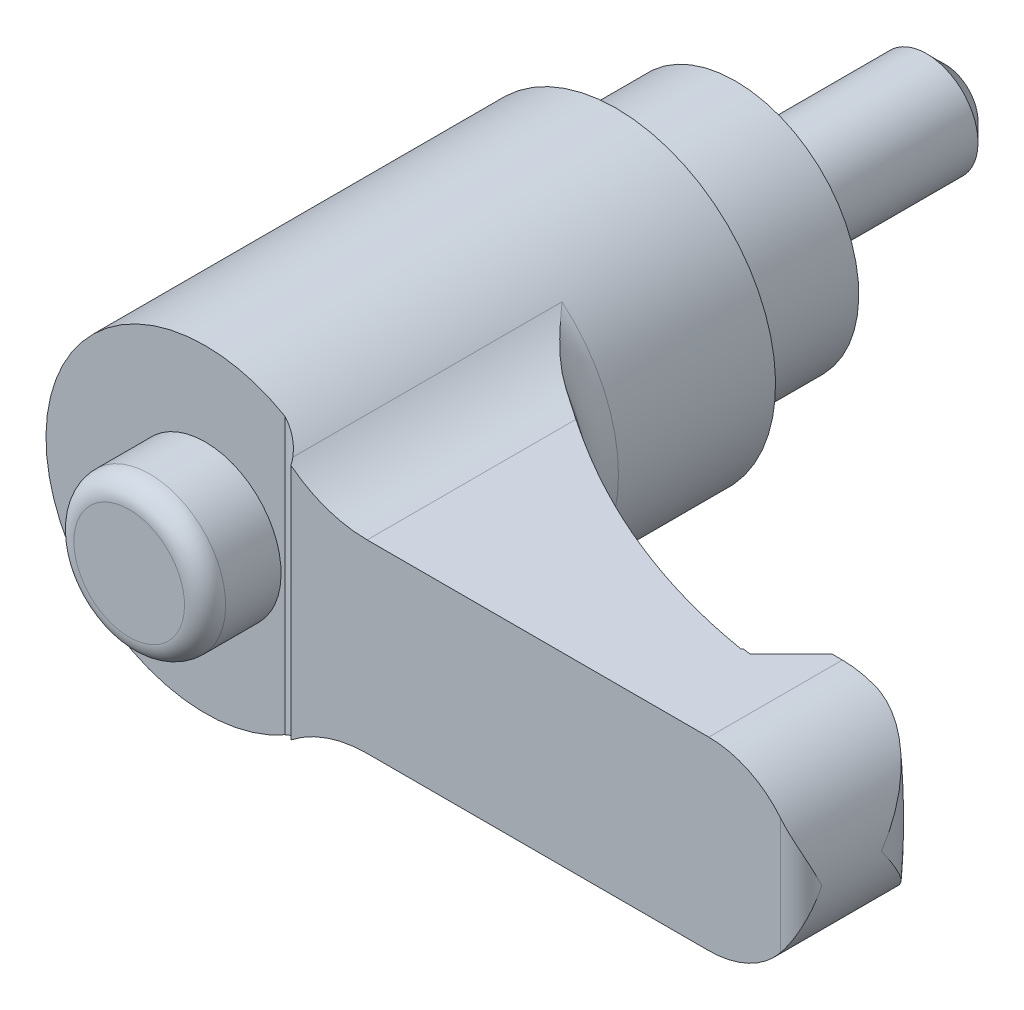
ISO-10303-21;
HEADER;
FILE_DESCRIPTION(('STEP AP214'),'2;1');
FILE_NAME('part.step','',(''),(''),'','','');
FILE_SCHEMA(('AUTOMOTIVE_DESIGN { 1 0 10303 214 1 1 1 1 }'));
ENDSEC;
DATA;
#1=APPLICATION_CONTEXT('core data for automotive mechanical design processes');
#2=APPLICATION_PROTOCOL_DEFINITION('international standard','automotive_design',2000,#1);
#3=PRODUCT_CONTEXT('',#1,'mechanical');
#4=PRODUCT('Part','Part','',(#3));
#5=PRODUCT_RELATED_PRODUCT_CATEGORY('part','',(#4));
#6=PRODUCT_DEFINITION_FORMATION('','',#4);
#7=PRODUCT_DEFINITION_CONTEXT('part definition',#1,'design');
#8=PRODUCT_DEFINITION('design','',#6,#7);
#9=PRODUCT_DEFINITION_SHAPE('','',#8);
#10=(LENGTH_UNIT() NAMED_UNIT(*) SI_UNIT(.MILLI.,.METRE.));
#11=(NAMED_UNIT(*) PLANE_ANGLE_UNIT() SI_UNIT($,.RADIAN.));
#12=(NAMED_UNIT(*) SI_UNIT($,.STERADIAN.) SOLID_ANGLE_UNIT());
#13=UNCERTAINTY_MEASURE_WITH_UNIT(LENGTH_MEASURE(1.E-05),#10,'distance_accuracy_value','');
#14=(GEOMETRIC_REPRESENTATION_CONTEXT(3) GLOBAL_UNCERTAINTY_ASSIGNED_CONTEXT((#13)) GLOBAL_UNIT_ASSIGNED_CONTEXT((#10,
#11,#12)) REPRESENTATION_CONTEXT('',''));
#15=CARTESIAN_POINT('',(0.,0.,0.));
#16=DIRECTION('',(0.,0.,1.));
#17=DIRECTION('',(1.,0.,0.));
#18=AXIS2_PLACEMENT_3D('',#15,#16,#17);
#19=CARTESIAN_POINT('',(4.8,0.,0.));
#20=DIRECTION('',(0.,0.,1.));
#21=DIRECTION('',(0.,-1.,0.));
#22=AXIS2_PLACEMENT_3D('',#19,#20,#21);
#23=PLANE('',#22);
#24=CARTESIAN_POINT('',(0.,0.,0.));
#25=DIRECTION('',(0.,0.,-1.));
#26=DIRECTION('',(0.,1.,0.));
#27=AXIS2_PLACEMENT_3D('',#24,#25,#26);
#28=CIRCLE('',#27,2.5);
#29=CARTESIAN_POINT('',(0.,2.5,0.));
#30=VERTEX_POINT('',#29);
#31=EDGE_CURVE('E493',#30,#30,#28,.T.);
#32=ORIENTED_EDGE('',*,*,#31,.F.);
#33=EDGE_LOOP('',(#32));
#34=FACE_BOUND('',#33,.T.);
#35=CARTESIAN_POINT('',(0.,0.,0.));
#36=DIRECTION('',(0.,0.,-1.));
#37=DIRECTION('',(0.,1.,0.));
#38=AXIS2_PLACEMENT_3D('',#35,#36,#37);
#39=CIRCLE('',#38,4.8);
#40=CARTESIAN_POINT('',(0.,4.8,0.));
#41=VERTEX_POINT('',#40);
#42=EDGE_CURVE('E433',#41,#41,#39,.T.);
#43=ORIENTED_EDGE('',*,*,#42,.T.);
#44=EDGE_LOOP('',(#43));
#45=FACE_BOUND('',#44,.T.);
#46=ADVANCED_FACE('F14',(#34,#45),#23,.F.);
#47=CARTESIAN_POINT('',(0.,0.,26.));
#48=DIRECTION('',(0.,0.,-1.));
#49=DIRECTION('',(0.,1.,0.));
#50=AXIS2_PLACEMENT_3D('',#47,#48,#49);
#51=PLANE('',#50);
#52=CARTESIAN_POINT('',(0.,0.,26.));
#53=DIRECTION('',(0.,0.,-1.));
#54=DIRECTION('',(0.,1.,0.));
#55=AXIS2_PLACEMENT_3D('',#52,#53,#54);
#56=CIRCLE('',#55,7.75);
#57=CARTESIAN_POINT('',(3.875,-6.7116968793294,26.));
#58=VERTEX_POINT('',#57);
#59=CARTESIAN_POINT('',(3.875,6.7116968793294,26.));
#60=VERTEX_POINT('',#59);
#61=EDGE_CURVE('E380',#58,#60,#56,.T.);
#62=ORIENTED_EDGE('',*,*,#61,.F.);
#63=DIRECTION('',(0.,1.,0.));
#64=VECTOR('',#63,1.);
#65=CARTESIAN_POINT('',(3.875,-9.,26.));
#66=LINE('',#65,#64);
#67=EDGE_CURVE('E467',#58,#60,#66,.T.);
#68=ORIENTED_EDGE('',*,*,#67,.T.);
#69=EDGE_LOOP('',(#62,#68));
#70=FACE_BOUND('',#69,.T.);
#71=CARTESIAN_POINT('',(0.,0.,26.));
#72=DIRECTION('',(0.,0.,-1.));
#73=DIRECTION('',(0.,1.,0.));
#74=AXIS2_PLACEMENT_3D('',#71,#72,#73);
#75=CIRCLE('',#74,3.69047619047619);
#76=CARTESIAN_POINT('',(0.,3.69047619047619,26.));
#77=VERTEX_POINT('',#76);
#78=EDGE_CURVE('E188',#77,#77,#75,.F.);
#79=ORIENTED_EDGE('',*,*,#78,.F.);
#80=EDGE_LOOP('',(#79));
#81=FACE_BOUND('',#80,.T.);
#82=ADVANCED_FACE('F163',(#70,#81),#51,.F.);
#83=CARTESIAN_POINT('',(25.5,0.,0.));
#84=DIRECTION('',(0.,0.,1.));
#85=DIRECTION('',(0.,-1.,0.));
#86=AXIS2_PLACEMENT_3D('',#83,#84,#85);
#87=CYLINDRICAL_SURFACE('',#86,4.5);
#88=CARTESIAN_POINT('',(30.,0.,23.1));
#89=CARTESIAN_POINT('',(30.0000000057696,-0.00397224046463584,23.0972162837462));
#90=CARTESIAN_POINT('',(29.9999947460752,-0.00794462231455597,23.0944324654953));
#91=CARTESIAN_POINT('',(29.9991779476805,-0.316207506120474,22.8784039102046));
#92=CARTESIAN_POINT('',(29.967472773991,-0.621260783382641,22.6646232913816));
#93=CARTESIAN_POINT('',(29.8729566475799,-1.07288244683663,22.3499400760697));
#94=CARTESIAN_POINT('',(29.8335087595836,-1.2227001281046,22.2458576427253));
#95=CARTESIAN_POINT('',(29.7386099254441,-1.51933949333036,22.0407893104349));
#96=CARTESIAN_POINT('',(29.6831664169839,-1.6661625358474,21.9398019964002));
#97=CARTESIAN_POINT('',(29.5225221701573,-2.0316181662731,21.690355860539));
#98=CARTESIAN_POINT('',(29.4064726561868,-2.24755940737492,21.5447545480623));
#99=CARTESIAN_POINT('',(29.1349908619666,-2.66429651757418,21.2699985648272));
#100=CARTESIAN_POINT('',(28.9796468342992,-2.86512503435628,21.1408080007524));
#101=CARTESIAN_POINT('',(28.6740094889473,-3.19567948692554,20.9378778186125));
#102=CARTESIAN_POINT('',(28.5328529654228,-3.3303385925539,20.8584463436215));
#103=CARTESIAN_POINT('',(28.2285136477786,-3.58389708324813,20.7186599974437));
#104=CARTESIAN_POINT('',(28.0653563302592,-3.70281438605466,20.6582833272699));
#105=CARTESIAN_POINT('',(27.7569268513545,-3.89637158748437,20.5739705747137));
#106=CARTESIAN_POINT('',(27.6155988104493,-3.97499958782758,20.5449430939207));
#107=CARTESIAN_POINT('',(27.3962983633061,-4.08175109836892,20.516319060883));
#108=CARTESIAN_POINT('',(27.3219652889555,-4.11547521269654,20.5092639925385));
#109=CARTESIAN_POINT('',(27.1713145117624,-4.17892025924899,20.5006475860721));
#110=CARTESIAN_POINT('',(27.0949977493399,-4.20864304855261,20.4990836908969));
#111=CARTESIAN_POINT('',(26.940135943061,-4.26413478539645,20.5019689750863));
#112=CARTESIAN_POINT('',(26.8615759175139,-4.28985895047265,20.5064814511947));
#113=CARTESIAN_POINT('',(26.7037978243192,-4.33677756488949,20.5220962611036));
#114=CARTESIAN_POINT('',(26.624580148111,-4.35797453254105,20.5331949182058));
#115=CARTESIAN_POINT('',(26.4663684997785,-4.39576374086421,20.5623470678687));
#116=CARTESIAN_POINT('',(26.3873744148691,-4.41235899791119,20.5803959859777));
#117=CARTESIAN_POINT('',(26.230581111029,-4.44101436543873,20.6236628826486));
#118=CARTESIAN_POINT('',(26.1527814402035,-4.4530762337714,20.6488780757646));
#119=CARTESIAN_POINT('',(25.9747863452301,-4.47604389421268,20.7158088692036));
#120=CARTESIAN_POINT('',(25.8753706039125,-4.48535121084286,20.7602222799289));
#121=CARTESIAN_POINT('',(25.7308199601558,-4.4943380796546,20.836059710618));
#122=CARTESIAN_POINT('',(25.6833620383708,-4.49650441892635,20.8629005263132));
#123=CARTESIAN_POINT('',(25.5902043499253,-4.4993369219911,20.9195771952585));
#124=CARTESIAN_POINT('',(25.5445050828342,-4.50000266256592,20.9494138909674));
#125=CARTESIAN_POINT('',(25.4998,-4.49999999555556,20.980704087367));
#126=B_SPLINE_CURVE_WITH_KNOTS('',3,(#88,#89,#90,#91,#92,#93,#94,#95,#96,#97,#98,#99,#100,#101,
#102,#103,#104,#105,#106,#107,#108,#109,#110,#111,#112,#113,#114,#115,#116,#117,#118,#119,#120,
#121,#122,#123,#124,#125),.UNSPECIFIED.,.F.,.F.,(4,2,2,2,2,2,2,2,2,2,2,2,2,2,2,2,2,2,4),(0.,
0.0145521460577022,1.12923174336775,1.68863416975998,2.24777690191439,3.0999476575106,
3.95022123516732,4.58000022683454,5.20905610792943,5.69992949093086,5.94545977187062,
6.19087570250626,6.43886797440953,6.68672193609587,6.93441304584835,7.18200801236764,
7.50864895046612,7.67223429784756,7.83586577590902),.UNSPECIFIED.);
#127=CARTESIAN_POINT('',(27.0737254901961,-4.21584962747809,20.5));
#128=VERTEX_POINT('',#127);
#129=CARTESIAN_POINT('',(30.,0.,23.1));
#130=VERTEX_POINT('',#129);
#131=EDGE_CURVE('E133',#128,#130,#126,.F.);
#132=ORIENTED_EDGE('',*,*,#131,.T.);
#133=CARTESIAN_POINT('',(30.,0.,23.1));
#134=CARTESIAN_POINT('',(30.0000000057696,0.00397224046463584,23.0972162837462));
#135=CARTESIAN_POINT('',(29.9999947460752,0.00794462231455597,23.0944324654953));
#136=CARTESIAN_POINT('',(29.9991779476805,0.316207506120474,22.8784039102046));
#137=CARTESIAN_POINT('',(29.967472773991,0.621260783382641,22.6646232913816));
#138=CARTESIAN_POINT('',(29.8729566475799,1.07288244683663,22.3499400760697));
#139=CARTESIAN_POINT('',(29.8335087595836,1.2227001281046,22.2458576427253));
#140=CARTESIAN_POINT('',(29.7386099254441,1.51933949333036,22.0407893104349));
#141=CARTESIAN_POINT('',(29.6831664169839,1.6661625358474,21.9398019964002));
#142=CARTESIAN_POINT('',(29.5225221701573,2.0316181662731,21.690355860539));
#143=CARTESIAN_POINT('',(29.4064726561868,2.24755940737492,21.5447545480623));
#144=CARTESIAN_POINT('',(29.1349908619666,2.66429651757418,21.2699985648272));
#145=CARTESIAN_POINT('',(28.9796468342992,2.86512503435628,21.1408080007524));
#146=CARTESIAN_POINT('',(28.6740094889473,3.19567948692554,20.9378778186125));
#147=CARTESIAN_POINT('',(28.5328529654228,3.3303385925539,20.8584463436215));
#148=CARTESIAN_POINT('',(28.2285136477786,3.58389708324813,20.7186599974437));
#149=CARTESIAN_POINT('',(28.0653563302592,3.70281438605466,20.6582833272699));
#150=CARTESIAN_POINT('',(27.7569268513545,3.89637158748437,20.5739705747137));
#151=CARTESIAN_POINT('',(27.6155988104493,3.97499958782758,20.5449430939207));
#152=CARTESIAN_POINT('',(27.3962983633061,4.08175109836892,20.516319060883));
#153=CARTESIAN_POINT('',(27.3219652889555,4.11547521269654,20.5092639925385));
#154=CARTESIAN_POINT('',(27.1713145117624,4.17892025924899,20.5006475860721));
#155=CARTESIAN_POINT('',(27.0949977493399,4.20864304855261,20.4990836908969));
#156=CARTESIAN_POINT('',(26.940135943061,4.26413478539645,20.5019689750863));
#157=CARTESIAN_POINT('',(26.8615759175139,4.28985895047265,20.5064814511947));
#158=CARTESIAN_POINT('',(26.7037978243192,4.33677756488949,20.5220962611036));
#159=CARTESIAN_POINT('',(26.624580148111,4.35797453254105,20.5331949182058));
#160=CARTESIAN_POINT('',(26.4663684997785,4.39576374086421,20.5623470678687));
#161=CARTESIAN_POINT('',(26.3873744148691,4.41235899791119,20.5803959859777));
#162=CARTESIAN_POINT('',(26.230581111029,4.44101436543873,20.6236628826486));
#163=CARTESIAN_POINT('',(26.1527814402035,4.4530762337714,20.6488780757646));
#164=CARTESIAN_POINT('',(25.9747863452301,4.47604389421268,20.7158088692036));
#165=CARTESIAN_POINT('',(25.8753706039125,4.48535121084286,20.7602222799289));
#166=CARTESIAN_POINT('',(25.7308199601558,4.4943380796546,20.836059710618));
#167=CARTESIAN_POINT('',(25.6833620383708,4.49650441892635,20.8629005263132));
#168=CARTESIAN_POINT('',(25.5902043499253,4.4993369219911,20.9195771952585));
#169=CARTESIAN_POINT('',(25.5445050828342,4.50000266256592,20.9494138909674));
#170=CARTESIAN_POINT('',(25.4998,4.49999999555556,20.980704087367));
#171=B_SPLINE_CURVE_WITH_KNOTS('',3,(#133,#134,#135,#136,#137,#138,#139,#140,#141,#142,#143,
#144,#145,#146,#147,#148,#149,#150,#151,#152,#153,#154,#155,#156,#157,#158,#159,#160,#161,#162,
#163,#164,#165,#166,#167,#168,#169,#170),.UNSPECIFIED.,.F.,.F.,(4,2,2,2,2,2,2,2,2,2,2,2,2,2,2,2,
2,2,4),(0.,0.0145521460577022,1.12923174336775,1.68863416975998,2.24777690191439,
3.0999476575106,3.95022123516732,4.58000022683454,5.20905610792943,5.69992949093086,
5.94545977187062,6.19087570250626,6.43886797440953,6.68672193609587,6.93441304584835,
7.18200801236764,7.50864895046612,7.67223429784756,7.83586577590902),.UNSPECIFIED.);
#172=CARTESIAN_POINT('',(27.0737254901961,4.21584962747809,20.5));
#173=VERTEX_POINT('',#172);
#174=EDGE_CURVE('E130',#130,#173,#171,.T.);
#175=ORIENTED_EDGE('',*,*,#174,.T.);
#176=CARTESIAN_POINT('',(25.5,0.,20.5));
#177=DIRECTION('',(0.,0.,-1.));
#178=DIRECTION('',(0.,1.,0.));
#179=AXIS2_PLACEMENT_3D('',#176,#177,#178);
#180=CIRCLE('',#179,4.5);
#181=CARTESIAN_POINT('',(25.5,4.5,20.5));
#182=VERTEX_POINT('',#181);
#183=EDGE_CURVE('E405',#173,#182,#180,.F.);
#184=ORIENTED_EDGE('',*,*,#183,.T.);
#185=DIRECTION('',(0.,0.,1.));
#186=VECTOR('',#185,1.);
#187=CARTESIAN_POINT('',(25.5,4.5,0.));
#188=LINE('',#187,#186);
#189=CARTESIAN_POINT('',(25.5,4.5,27.));
#190=VERTEX_POINT('',#189);
#191=EDGE_CURVE('E404',#182,#190,#188,.T.);
#192=ORIENTED_EDGE('',*,*,#191,.T.);
#193=CARTESIAN_POINT('',(25.5,0.,27.));
#194=DIRECTION('',(0.,0.,1.));
#195=DIRECTION('',(0.,-1.,0.));
#196=AXIS2_PLACEMENT_3D('',#193,#194,#195);
#197=CIRCLE('',#196,4.5);
#198=CARTESIAN_POINT('',(29.,2.82842712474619,27.));
#199=VERTEX_POINT('',#198);
#200=EDGE_CURVE('E383',#199,#190,#197,.T.);
#201=ORIENTED_EDGE('',*,*,#200,.F.);
#202=CARTESIAN_POINT('',(29.,2.82842712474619,27.));
#203=CARTESIAN_POINT('',(29.0452569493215,2.77244060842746,26.9999705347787));
#204=CARTESIAN_POINT('',(29.08910814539,2.71541373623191,26.9969310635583));
#205=CARTESIAN_POINT('',(29.1737346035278,2.59976408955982,26.9857221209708));
#206=CARTESIAN_POINT('',(29.2145155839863,2.54114457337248,26.9775624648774));
#207=CARTESIAN_POINT('',(29.2926216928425,2.42301598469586,26.9570723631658));
#208=CARTESIAN_POINT('',(29.3299701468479,2.36351669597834,26.9447732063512));
#209=CARTESIAN_POINT('',(29.4015263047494,2.24343051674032,26.9166544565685));
#210=CARTESIAN_POINT('',(29.4357319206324,2.18284293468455,26.9008325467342));
#211=CARTESIAN_POINT('',(29.5205149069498,2.0242761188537,26.8558925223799));
#212=CARTESIAN_POINT('',(29.5686353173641,1.92562477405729,26.8244847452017));
#213=CARTESIAN_POINT('',(29.6569408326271,1.7267576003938,26.7560098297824));
#214=CARTESIAN_POINT('',(29.6971228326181,1.62654117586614,26.7189404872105));
#215=CARTESIAN_POINT('',(29.769924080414,1.42454335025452,26.6403878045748));
#216=CARTESIAN_POINT('',(29.8025090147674,1.32275698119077,26.5988856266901));
#217=CARTESIAN_POINT('',(29.8600923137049,1.1184186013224,26.5127603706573));
#218=CARTESIAN_POINT('',(29.8850925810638,1.0158667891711,26.4681380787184));
#219=CARTESIAN_POINT('',(29.9373931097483,0.763467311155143,26.3559210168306));
#220=CARTESIAN_POINT('',(29.9605764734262,0.613303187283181,26.2871011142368));
#221=CARTESIAN_POINT('',(29.9916507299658,0.312779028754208,26.1474204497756));
#222=CARTESIAN_POINT('',(29.999578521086,0.162420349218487,26.0765650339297));
#223=CARTESIAN_POINT('',(29.9999945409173,0.00809034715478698,26.0038138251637));
#224=CARTESIAN_POINT('',(29.999999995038,0.00404514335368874,26.0019068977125));
#225=CARTESIAN_POINT('',(30.,0.,26.));
#226=B_SPLINE_CURVE_WITH_KNOTS('',3,(#202,#203,#204,#205,#206,#207,#208,#209,#210,#211,#212,
#213,#214,#215,#216,#217,#218,#219,#220,#221,#222,#223,#224,#225),.UNSPECIFIED.,.F.,.F.,(4,2,2,
2,2,2,2,2,2,2,2,4),(0.,0.215782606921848,0.431152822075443,0.644930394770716,0.858848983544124,
1.20082332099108,1.5429311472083,1.88655545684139,2.23009348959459,2.7297347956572,
3.22816610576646,3.2415825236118),.UNSPECIFIED.);
#227=CARTESIAN_POINT('',(30.,0.,26.));
#228=VERTEX_POINT('',#227);
#229=EDGE_CURVE('E174',#228,#199,#226,.F.);
#230=ORIENTED_EDGE('',*,*,#229,.F.);
#231=CARTESIAN_POINT('',(29.,-2.82842712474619,27.));
#232=CARTESIAN_POINT('',(29.0452569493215,-2.77244060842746,26.9999705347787));
#233=CARTESIAN_POINT('',(29.08910814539,-2.71541373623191,26.9969310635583));
#234=CARTESIAN_POINT('',(29.1737346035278,-2.59976408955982,26.9857221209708));
#235=CARTESIAN_POINT('',(29.2145155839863,-2.54114457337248,26.9775624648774));
#236=CARTESIAN_POINT('',(29.2926216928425,-2.42301598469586,26.9570723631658));
#237=CARTESIAN_POINT('',(29.3299701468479,-2.36351669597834,26.9447732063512));
#238=CARTESIAN_POINT('',(29.4015263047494,-2.24343051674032,26.9166544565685));
#239=CARTESIAN_POINT('',(29.4357319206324,-2.18284293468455,26.9008325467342));
#240=CARTESIAN_POINT('',(29.5205149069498,-2.0242761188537,26.8558925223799));
#241=CARTESIAN_POINT('',(29.5686353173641,-1.92562477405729,26.8244847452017));
#242=CARTESIAN_POINT('',(29.6569408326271,-1.7267576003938,26.7560098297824));
#243=CARTESIAN_POINT('',(29.6971228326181,-1.62654117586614,26.7189404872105));
#244=CARTESIAN_POINT('',(29.769924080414,-1.42454335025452,26.6403878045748));
#245=CARTESIAN_POINT('',(29.8025090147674,-1.32275698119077,26.5988856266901));
#246=CARTESIAN_POINT('',(29.8600923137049,-1.1184186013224,26.5127603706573));
#247=CARTESIAN_POINT('',(29.8850925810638,-1.0158667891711,26.4681380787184));
#248=CARTESIAN_POINT('',(29.9373931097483,-0.763467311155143,26.3559210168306));
#249=CARTESIAN_POINT('',(29.9605764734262,-0.613303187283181,26.2871011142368));
#250=CARTESIAN_POINT('',(29.9916507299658,-0.312779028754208,26.1474204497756));
#251=CARTESIAN_POINT('',(29.999578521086,-0.162420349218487,26.0765650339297));
#252=CARTESIAN_POINT('',(29.9999945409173,-0.00809034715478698,26.0038138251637));
#253=CARTESIAN_POINT('',(29.999999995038,-0.00404514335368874,26.0019068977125));
#254=CARTESIAN_POINT('',(30.,0.,26.));
#255=B_SPLINE_CURVE_WITH_KNOTS('',3,(#231,#232,#233,#234,#235,#236,#237,#238,#239,#240,#241,
#242,#243,#244,#245,#246,#247,#248,#249,#250,#251,#252,#253,#254),.UNSPECIFIED.,.F.,.F.,(4,2,2,
2,2,2,2,2,2,2,2,4),(0.,0.215782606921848,0.431152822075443,0.644930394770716,0.858848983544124,
1.20082332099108,1.5429311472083,1.88655545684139,2.23009348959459,2.7297347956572,
3.22816610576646,3.2415825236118),.UNSPECIFIED.);
#256=CARTESIAN_POINT('',(29.,-2.82842712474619,27.));
#257=VERTEX_POINT('',#256);
#258=EDGE_CURVE('E182',#257,#228,#255,.T.);
#259=ORIENTED_EDGE('',*,*,#258,.F.);
#260=CARTESIAN_POINT('',(25.5,-4.5,27.));
#261=VERTEX_POINT('',#260);
#262=EDGE_CURVE('E389',#261,#257,#197,.T.);
#263=ORIENTED_EDGE('',*,*,#262,.F.);
#264=DIRECTION('',(0.,0.,1.));
#265=VECTOR('',#264,1.);
#266=CARTESIAN_POINT('',(25.5,-4.5,0.));
#267=LINE('',#266,#265);
#268=CARTESIAN_POINT('',(25.5,-4.5,20.5));
#269=VERTEX_POINT('',#268);
#270=EDGE_CURVE('E409',#269,#261,#267,.T.);
#271=ORIENTED_EDGE('',*,*,#270,.F.);
#272=EDGE_CURVE('E140',#269,#128,#180,.F.);
#273=ORIENTED_EDGE('',*,*,#272,.T.);
#274=EDGE_LOOP('',(#132,#175,#184,#192,#201,#230,#259,#263,#271,#273));
#275=FACE_BOUND('',#274,.T.);
#276=ADVANCED_FACE('F138',(#275),#87,.T.);
#277=CARTESIAN_POINT('',(28.072410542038,-9.,-7.06806810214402));
#278=DIRECTION('',(0.,1.,0.));
#279=DIRECTION('',(-1.,0.,0.));
#280=AXIS2_PLACEMENT_3D('',#277,#278,#279);
#281=CYLINDRICAL_SURFACE('',#280,30.);
#282=CARTESIAN_POINT('',(22.457864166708,5.40076351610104,22.4018635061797));
#283=CARTESIAN_POINT('',(22.5328704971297,5.02783315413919,22.4161416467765));
#284=CARTESIAN_POINT('',(22.6003478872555,4.65331694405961,22.4287120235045));
#285=CARTESIAN_POINT('',(22.7199001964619,3.90172149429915,22.4506465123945));
#286=CARTESIAN_POINT('',(22.7719742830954,3.52464211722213,22.4600104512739));
#287=CARTESIAN_POINT('',(22.860391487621,2.76836181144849,22.4757441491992));
#288=CARTESIAN_POINT('',(22.8967259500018,2.38915983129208,22.4821122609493));
#289=CARTESIAN_POINT('',(22.953399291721,1.62955869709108,22.4919810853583));
#290=CARTESIAN_POINT('',(22.9737386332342,1.24915957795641,22.4954818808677));
#291=CARTESIAN_POINT('',(23.0101209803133,0.119914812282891,22.5017516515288));
#292=CARTESIAN_POINT('',(23.0030278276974,-0.62982701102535,22.5005458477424));
#293=CARTESIAN_POINT('',(22.9265280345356,-2.12549757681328,22.487326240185));
#294=CARTESIAN_POINT('',(22.8571649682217,-2.87142861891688,22.4753199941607));
#295=CARTESIAN_POINT('',(22.717445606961,-3.91200869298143,22.450161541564));
#296=CARTESIAN_POINT('',(22.6723784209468,-4.21035002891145,22.4419679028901));
#297=CARTESIAN_POINT('',(22.5724363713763,-4.80637536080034,22.4235048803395));
#298=CARTESIAN_POINT('',(22.5175283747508,-5.10405358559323,22.4132284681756));
#299=CARTESIAN_POINT('',(22.457864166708,-5.40076351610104,22.4018635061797));
#300=B_SPLINE_CURVE_WITH_KNOTS('',3,(#282,#283,#284,#285,#286,#287,#288,#289,#290,#291,#292,
#293,#294,#295,#296,#297,#298,#299),.UNSPECIFIED.,.F.,.F.,(4,2,2,2,2,2,2,2,4),(0.,
1.14192528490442,2.28391227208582,3.4265264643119,4.56910763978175,6.81558260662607,
9.06048679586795,9.96586555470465,10.8743519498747),.UNSPECIFIED.);
#301=CARTESIAN_POINT('',(23.,0.,22.5));
#302=VERTEX_POINT('',#301);
#303=CARTESIAN_POINT('',(22.6238084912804,-4.5,22.4329951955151));
#304=VERTEX_POINT('',#303);
#305=EDGE_CURVE('E136',#302,#304,#300,.T.);
#306=ORIENTED_EDGE('',*,*,#305,.F.);
#307=DIRECTION('',(0.,1.,0.));
#308=VECTOR('',#307,1.);
#309=CARTESIAN_POINT('',(23.,-9.,22.5));
#310=LINE('',#309,#308);
#311=CARTESIAN_POINT('',(23.,-4.5,22.5));
#312=VERTEX_POINT('',#311);
#313=EDGE_CURVE('E473',#312,#302,#310,.T.);
#314=ORIENTED_EDGE('',*,*,#313,.F.);
#315=CARTESIAN_POINT('',(28.072410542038,-4.5,-7.06806810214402));
#316=DIRECTION('',(0.,1.,0.));
#317=DIRECTION('',(-1.,0.,0.));
#318=AXIS2_PLACEMENT_3D('',#315,#316,#317);
#319=CIRCLE('',#318,30.);
#320=EDGE_CURVE('E464',#312,#304,#319,.F.);
#321=ORIENTED_EDGE('',*,*,#320,.T.);
#322=EDGE_LOOP('',(#306,#314,#321));
#323=FACE_BOUND('',#322,.T.);
#324=ADVANCED_FACE('F162',(#323),#281,.F.);
#325=CARTESIAN_POINT('',(27.4,-9.,20.5));
#326=DIRECTION('',(0.,0.,-1.));
#327=DIRECTION('',(0.,1.,0.));
#328=AXIS2_PLACEMENT_3D('',#325,#326,#327);
#329=PLANE('',#328);
#330=ORIENTED_EDGE('',*,*,#183,.F.);
#331=CARTESIAN_POINT('',(0.,0.,20.5));
#332=DIRECTION('',(0.,0.,-1.));
#333=DIRECTION('',(0.,1.,0.));
#334=AXIS2_PLACEMENT_3D('',#331,#332,#333);
#335=CIRCLE('',#334,27.4);
#336=EDGE_CURVE('E37',#173,#128,#335,.T.);
#337=ORIENTED_EDGE('',*,*,#336,.T.);
#338=ORIENTED_EDGE('',*,*,#272,.F.);
#339=DIRECTION('',(-1.,0.,0.));
#340=VECTOR('',#339,1.);
#341=CARTESIAN_POINT('',(25.5,-4.5,20.5));
#342=LINE('',#341,#340);
#343=CARTESIAN_POINT('',(25.,-4.5,20.5));
#344=VERTEX_POINT('',#343);
#345=EDGE_CURVE('E540',#269,#344,#342,.T.);
#346=ORIENTED_EDGE('',*,*,#345,.T.);
#347=DIRECTION('',(0.,1.,0.));
#348=VECTOR('',#347,1.);
#349=CARTESIAN_POINT('',(25.,-9.,20.5));
#350=LINE('',#349,#348);
#351=CARTESIAN_POINT('',(25.,4.5,20.5));
#352=VERTEX_POINT('',#351);
#353=EDGE_CURVE('E460',#344,#352,#350,.T.);
#354=ORIENTED_EDGE('',*,*,#353,.T.);
#355=DIRECTION('',(1.,0.,0.));
#356=VECTOR('',#355,1.);
#357=CARTESIAN_POINT('',(8.87764045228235,4.5,20.5));
#358=LINE('',#357,#356);
#359=EDGE_CURVE('E419',#352,#182,#358,.T.);
#360=ORIENTED_EDGE('',*,*,#359,.T.);
#361=EDGE_LOOP('',(#330,#337,#338,#346,#354,#360));
#362=FACE_BOUND('',#361,.T.);
#363=ADVANCED_FACE('F196',(#362),#329,.T.);
#364=CARTESIAN_POINT('',(0.,0.,27.));
#365=DIRECTION('',(0.,0.,1.));
#366=DIRECTION('',(0.,-1.,0.));
#367=AXIS2_PLACEMENT_3D('',#364,#365,#366);
#368=PLANE('',#367);
#369=CARTESIAN_POINT('',(8.87764045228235,10.5,27.));
#370=DIRECTION('',(0.,0.,1.));
#371=DIRECTION('',(1.,0.,0.));
#372=AXIS2_PLACEMENT_3D('',#369,#370,#371);
#373=CIRCLE('',#372,6.);
#374=CARTESIAN_POINT('',(5.16666666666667,5.78527057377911,27.));
#375=VERTEX_POINT('',#374);
#376=CARTESIAN_POINT('',(8.87764045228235,4.5,27.));
#377=VERTEX_POINT('',#376);
#378=EDGE_CURVE('E414',#375,#377,#373,.T.);
#379=ORIENTED_EDGE('',*,*,#378,.F.);
#380=DIRECTION('',(0.,1.,0.));
#381=VECTOR('',#380,1.);
#382=CARTESIAN_POINT('',(5.16666666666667,-9.,27.));
#383=LINE('',#382,#381);
#384=CARTESIAN_POINT('',(5.16666666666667,-5.78527057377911,27.));
#385=VERTEX_POINT('',#384);
#386=EDGE_CURVE('E453',#385,#375,#383,.T.);
#387=ORIENTED_EDGE('',*,*,#386,.F.);
#388=CARTESIAN_POINT('',(8.87764045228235,-10.5,27.));
#389=DIRECTION('',(0.,0.,1.));
#390=DIRECTION('',(1.,0.,0.));
#391=AXIS2_PLACEMENT_3D('',#388,#389,#390);
#392=CIRCLE('',#391,6.);
#393=CARTESIAN_POINT('',(8.87764045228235,-4.5,27.));
#394=VERTEX_POINT('',#393);
#395=EDGE_CURVE('E417',#394,#385,#392,.T.);
#396=ORIENTED_EDGE('',*,*,#395,.F.);
#397=DIRECTION('',(-1.,0.,0.));
#398=VECTOR('',#397,1.);
#399=CARTESIAN_POINT('',(25.5,-4.5,27.));
#400=LINE('',#399,#398);
#401=EDGE_CURVE('E413',#261,#394,#400,.T.);
#402=ORIENTED_EDGE('',*,*,#401,.F.);
#403=ORIENTED_EDGE('',*,*,#262,.T.);
#404=DIRECTION('',(0.,1.,0.));
#405=VECTOR('',#404,1.);
#406=CARTESIAN_POINT('',(29.,-9.,27.));
#407=LINE('',#406,#405);
#408=EDGE_CURVE('E401',#257,#199,#407,.T.);
#409=ORIENTED_EDGE('',*,*,#408,.T.);
#410=ORIENTED_EDGE('',*,*,#200,.T.);
#411=DIRECTION('',(1.,0.,0.));
#412=VECTOR('',#411,1.);
#413=CARTESIAN_POINT('',(8.87764045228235,4.5,27.));
#414=LINE('',#413,#412);
#415=EDGE_CURVE('E400',#377,#190,#414,.T.);
#416=ORIENTED_EDGE('',*,*,#415,.F.);
#417=EDGE_LOOP('',(#379,#387,#396,#402,#403,#409,#410,#416));
#418=FACE_BOUND('',#417,.T.);
#419=ADVANCED_FACE('F244',(#418),#368,.T.);
#420=CARTESIAN_POINT('',(0.,0.,0.));
#421=DIRECTION('',(0.,0.,-1.));
#422=DIRECTION('',(0.,1.,0.));
#423=AXIS2_PLACEMENT_3D('',#420,#421,#422);
#424=CYLINDRICAL_SURFACE('',#423,7.75);
#425=CARTESIAN_POINT('',(0.,0.,13.6426560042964));
#426=DIRECTION('',(0.,0.,-1.));
#427=DIRECTION('',(0.,1.,0.));
#428=AXIS2_PLACEMENT_3D('',#425,#426,#427);
#429=CIRCLE('',#428,7.75);
#430=CARTESIAN_POINT('',(5.00376098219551,5.91818181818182,13.6426560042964));
#431=VERTEX_POINT('',#430);
#432=CARTESIAN_POINT('',(5.00376098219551,-5.91818181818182,13.6426560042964));
#433=VERTEX_POINT('',#432);
#434=EDGE_CURVE('E374',#431,#433,#429,.T.);
#435=ORIENTED_EDGE('',*,*,#434,.T.);
#436=DIRECTION('',(0.,0.,1.));
#437=VECTOR('',#436,1.);
#438=CARTESIAN_POINT('',(5.00376098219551,-5.91818181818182,0.));
#439=LINE('',#438,#437);
#440=CARTESIAN_POINT('',(5.00376098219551,-5.91818181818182,26.7442638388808));
#441=VERTEX_POINT('',#440);
#442=EDGE_CURVE('E425',#433,#441,#439,.T.);
#443=ORIENTED_EDGE('',*,*,#442,.T.);
#444=CARTESIAN_POINT('',(3.875,-6.7116968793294,26.));
#445=CARTESIAN_POINT('',(3.9487248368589,-6.66914880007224,26.0179048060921));
#446=CARTESIAN_POINT('',(4.02097408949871,-6.62579988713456,26.039874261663));
#447=CARTESIAN_POINT('',(4.16199829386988,-6.53812669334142,26.0915573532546));
#448=CARTESIAN_POINT('',(4.23077434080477,-6.49380272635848,26.1212685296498));
#449=CARTESIAN_POINT('',(4.36202505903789,-6.40634475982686,26.1868862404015));
#450=CARTESIAN_POINT('',(4.42463632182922,-6.36322379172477,26.2225378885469));
#451=CARTESIAN_POINT('',(4.54579687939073,-6.27724013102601,26.3004737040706));
#452=CARTESIAN_POINT('',(4.60434578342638,-6.23437746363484,26.3427585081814));
#453=CARTESIAN_POINT('',(4.71026264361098,-6.1546555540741,26.4283893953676));
#454=CARTESIAN_POINT('',(4.75813291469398,-6.11768751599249,26.4710140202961));
#455=CARTESIAN_POINT('',(4.8500303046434,-6.04509175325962,26.56120031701));
#456=CARTESIAN_POINT('',(4.89405965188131,-6.00946325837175,26.6087590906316));
#457=CARTESIAN_POINT('',(4.97925799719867,-5.9390764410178,26.7103994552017));
#458=CARTESIAN_POINT('',(5.02029084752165,-5.90438218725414,26.7646407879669));
#459=CARTESIAN_POINT('',(5.09738332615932,-5.83796295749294,26.8783962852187));
#460=CARTESIAN_POINT('',(5.13343386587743,-5.80624344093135,26.9379197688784));
#461=CARTESIAN_POINT('',(5.16666666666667,-5.77650894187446,27.));
#462=B_SPLINE_CURVE_WITH_KNOTS('',3,(#444,#445,#446,#447,#448,#449,#450,#451,#452,#453,#454,
#455,#456,#457,#458,#459,#460,#461),.UNSPECIFIED.,.F.,.F.,(4,2,2,2,2,2,2,2,4),(0.,
0.260811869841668,0.521540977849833,0.773092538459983,1.02466826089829,1.24638864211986,
1.4679795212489,1.69664297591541,1.92571819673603),.UNSPECIFIED.);
#463=EDGE_CURVE('E218',#58,#441,#462,.T.);
#464=ORIENTED_EDGE('',*,*,#463,.F.);
#465=ORIENTED_EDGE('',*,*,#61,.T.);
#466=CARTESIAN_POINT('',(5.16666666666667,5.77650894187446,27.));
#467=CARTESIAN_POINT('',(5.13714077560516,5.80292379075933,26.9448365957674));
#468=CARTESIAN_POINT('',(5.1053831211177,5.83091583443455,26.8916890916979));
#469=CARTESIAN_POINT('',(5.03785941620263,5.88934998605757,26.7895453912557));
#470=CARTESIAN_POINT('',(5.00209830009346,5.91978906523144,26.7405442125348));
#471=CARTESIAN_POINT('',(4.92700880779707,5.98243056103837,26.646752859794));
#472=CARTESIAN_POINT('',(4.88768622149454,6.01463008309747,26.6019560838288));
#473=CARTESIAN_POINT('',(4.80573825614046,6.08030777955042,26.5165060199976));
#474=CARTESIAN_POINT('',(4.76311181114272,6.11378636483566,26.4758540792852));
#475=CARTESIAN_POINT('',(4.63114473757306,6.21507952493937,26.3605779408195));
#476=CARTESIAN_POINT('',(4.53728284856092,6.28411879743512,26.2920994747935));
#477=CARTESIAN_POINT('',(4.3393749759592,6.42237347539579,26.1724069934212));
#478=CARTESIAN_POINT('',(4.23533663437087,6.49158871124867,26.1211801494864));
#479=CARTESIAN_POINT('',(4.08621326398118,6.5854168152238,26.0632790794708));
#480=CARTESIAN_POINT('',(4.04469277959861,6.61100425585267,26.0487072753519));
#481=CARTESIAN_POINT('',(3.96061680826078,6.66171281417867,26.0222973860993));
#482=CARTESIAN_POINT('',(3.91806319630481,6.68683464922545,26.0104547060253));
#483=CARTESIAN_POINT('',(3.8750000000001,6.7116968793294,26.));
#484=B_SPLINE_CURVE_WITH_KNOTS('',3,(#466,#467,#468,#469,#470,#471,#472,#473,#474,#475,#476,
#477,#478,#479,#480,#481,#482,#483),.UNSPECIFIED.,.F.,.F.,(4,2,2,2,2,2,2,2,4),(0.,
0.203583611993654,0.406919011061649,0.609929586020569,0.813005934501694,1.21684507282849,
1.62038324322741,1.77301957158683,1.9253970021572),.UNSPECIFIED.);
#485=CARTESIAN_POINT('',(5.0037609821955,5.91818181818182,26.7442638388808));
#486=VERTEX_POINT('',#485);
#487=EDGE_CURVE('E232',#486,#60,#484,.T.);
#488=ORIENTED_EDGE('',*,*,#487,.F.);
#489=DIRECTION('',(0.,0.,1.));
#490=VECTOR('',#489,1.);
#491=CARTESIAN_POINT('',(5.00376098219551,5.91818181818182,0.));
#492=LINE('',#491,#490);
#493=EDGE_CURVE('E431',#431,#486,#492,.T.);
#494=ORIENTED_EDGE('',*,*,#493,.F.);
#495=EDGE_LOOP('',(#435,#443,#464,#465,#488,#494));
#496=FACE_BOUND('',#495,.T.);
#497=CARTESIAN_POINT('',(0.,0.,6.));
#498=DIRECTION('',(0.,0.,-1.));
#499=DIRECTION('',(0.,1.,0.));
#500=AXIS2_PLACEMENT_3D('',#497,#498,#499);
#501=CIRCLE('',#500,7.75);
#502=CARTESIAN_POINT('',(0.,7.75,6.));
#503=VERTEX_POINT('',#502);
#504=EDGE_CURVE('E378',#503,#503,#501,.T.);
#505=ORIENTED_EDGE('',*,*,#504,.F.);
#506=EDGE_LOOP('',(#505));
#507=FACE_BOUND('',#506,.T.);
#508=ADVANCED_FACE('F242',(#496,#507),#424,.T.);
#509=CARTESIAN_POINT('',(8.87764045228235,10.5,0.));
#510=DIRECTION('',(0.,0.,1.));
#511=DIRECTION('',(0.,-1.,0.));
#512=AXIS2_PLACEMENT_3D('',#509,#510,#511);
#513=CYLINDRICAL_SURFACE('',#512,6.);
#514=DIRECTION('',(0.,0.,1.));
#515=VECTOR('',#514,1.);
#516=CARTESIAN_POINT('',(8.87764045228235,4.5,0.));
#517=LINE('',#516,#515);
#518=CARTESIAN_POINT('',(8.87764045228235,4.5,16.8419191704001));
#519=VERTEX_POINT('',#518);
#520=EDGE_CURVE('E408',#519,#377,#517,.T.);
#521=ORIENTED_EDGE('',*,*,#520,.F.);
#522=CARTESIAN_POINT('',(8.87784045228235,4.50000000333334,16.8420543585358));
#523=CARTESIAN_POINT('',(8.76298675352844,4.50000678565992,16.7644412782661));
#524=CARTESIAN_POINT('',(8.64795886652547,4.50329006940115,16.687069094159));
#525=CARTESIAN_POINT('',(8.41786670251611,4.51653249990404,16.5336144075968));
#526=CARTESIAN_POINT('',(8.30280331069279,4.52647413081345,16.457529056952));
#527=CARTESIAN_POINT('',(8.07233993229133,4.55315590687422,16.3070362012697));
#528=CARTESIAN_POINT('',(7.95693991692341,4.56989665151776,16.2326288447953));
#529=CARTESIAN_POINT('',(7.72548993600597,4.61048878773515,16.0861329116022));
#530=CARTESIAN_POINT('',(7.60943905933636,4.63435875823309,16.0140509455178));
#531=CARTESIAN_POINT('',(7.49320434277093,4.66190641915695,15.9436475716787));
#532=B_SPLINE_CURVE_WITH_KNOTS('',3,(#522,#523,#524,#525,#526,#527,#528,#529,#530,#531),
.UNSPECIFIED.,.F.,.F.,(4,2,2,2,4),(0.,0.415830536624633,0.830571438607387,1.24534891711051,
1.66121688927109),.UNSPECIFIED.);
#533=CARTESIAN_POINT('',(7.49353468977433,4.66182809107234,15.9438475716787));
#534=VERTEX_POINT('',#533);
#535=EDGE_CURVE('E258',#519,#534,#532,.T.);
#536=ORIENTED_EDGE('',*,*,#535,.T.);
#537=CARTESIAN_POINT('',(7.49386505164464,4.66174977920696,15.9440475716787));
#538=CARTESIAN_POINT('',(7.41534599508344,4.68036361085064,15.8965108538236));
#539=CARTESIAN_POINT('',(7.33813459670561,4.70033346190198,15.8474028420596));
#540=CARTESIAN_POINT('',(7.18628313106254,4.74278447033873,15.7464454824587));
#541=CARTESIAN_POINT('',(7.11164195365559,4.76526452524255,15.694597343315));
#542=CARTESIAN_POINT('',(6.89171782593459,4.83609524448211,15.5357042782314));
#543=CARTESIAN_POINT('',(6.75010221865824,4.88791699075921,15.4251060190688));
#544=CARTESIAN_POINT('',(6.47674906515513,4.99932791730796,15.1976148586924));
#545=CARTESIAN_POINT('',(6.34496293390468,5.05887426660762,15.0807586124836));
#546=CARTESIAN_POINT('',(6.08952700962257,5.18523508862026,14.8421034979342));
#547=CARTESIAN_POINT('',(5.96588083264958,5.25205275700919,14.7203024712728));
#548=CARTESIAN_POINT('',(5.6959472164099,5.41010140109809,14.4425118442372));
#549=CARTESIAN_POINT('',(5.55174299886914,5.50325599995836,14.2855983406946));
#550=CARTESIAN_POINT('',(5.27355500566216,5.70004368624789,13.9693256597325));
#551=CARTESIAN_POINT('',(5.13957057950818,5.80367610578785,13.8099666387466));
#552=CARTESIAN_POINT('',(5.00807252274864,5.91453907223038,13.6479722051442));
#553=CARTESIAN_POINT('',(5.00591610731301,5.91635969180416,13.6453140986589));
#554=CARTESIAN_POINT('',(5.00376098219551,5.91818181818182,13.6426560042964));
#555=B_SPLINE_CURVE_WITH_KNOTS('',3,(#537,#538,#539,#540,#541,#542,#543,#544,#545,#546,#547,
#548,#549,#550,#551,#552,#553,#554),.UNSPECIFIED.,.F.,.F.,(4,2,2,2,2,2,2,2,4),(0.,
0.280888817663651,0.561654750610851,1.12199628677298,1.67935400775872,2.2369576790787,
2.93418472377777,3.63136735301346,3.6429980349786),.UNSPECIFIED.);
#556=EDGE_CURVE('E249',#534,#431,#555,.T.);
#557=ORIENTED_EDGE('',*,*,#556,.T.);
#558=ORIENTED_EDGE('',*,*,#493,.T.);
#559=CARTESIAN_POINT('',(5.16666666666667,5.78527057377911,27.));
#560=CARTESIAN_POINT('',(5.1544362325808,5.79489712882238,26.9771411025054));
#561=CARTESIAN_POINT('',(5.14182657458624,5.80489933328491,26.9546446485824));
#562=CARTESIAN_POINT('',(5.11593353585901,5.82561925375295,26.910451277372));
#563=CARTESIAN_POINT('',(5.10265156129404,5.83633549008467,26.8887528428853));
#564=CARTESIAN_POINT('',(5.07544919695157,5.85848632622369,26.8461383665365));
#565=CARTESIAN_POINT('',(5.06152881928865,5.86992091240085,26.8252223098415));
#566=CARTESIAN_POINT('',(5.03308032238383,5.89351543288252,26.784152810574));
#567=CARTESIAN_POINT('',(5.0185510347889,5.90567678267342,26.7640009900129));
#568=CARTESIAN_POINT('',(5.0037609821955,5.91818181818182,26.7442638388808));
#569=B_SPLINE_CURVE_WITH_KNOTS('',3,(#559,#560,#561,#562,#563,#564,#565,#566,#567,#568),
.UNSPECIFIED.,.F.,.F.,(4,2,2,2,4),(0.,0.0829550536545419,0.165743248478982,0.248529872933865,
0.331483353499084),.UNSPECIFIED.);
#570=EDGE_CURVE('E226',#375,#486,#569,.T.);
#571=ORIENTED_EDGE('',*,*,#570,.F.);
#572=ORIENTED_EDGE('',*,*,#378,.T.);
#573=EDGE_LOOP('',(#521,#536,#557,#558,#571,#572));
#574=FACE_BOUND('',#573,.T.);
#575=ADVANCED_FACE('F238',(#574),#513,.F.);
#576=CARTESIAN_POINT('',(8.87764045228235,4.5,0.));
#577=DIRECTION('',(0.,-1.,0.));
#578=DIRECTION('',(1.,0.,0.));
#579=AXIS2_PLACEMENT_3D('',#576,#577,#578);
#580=PLANE('',#579);
#581=CARTESIAN_POINT('',(28.072410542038,4.5,-7.06806810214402));
#582=DIRECTION('',(0.,-1.,0.));
#583=DIRECTION('',(1.,0.,0.));
#584=AXIS2_PLACEMENT_3D('',#581,#582,#583);
#585=CIRCLE('',#584,30.);
#586=CARTESIAN_POINT('',(22.6238084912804,4.5,22.432995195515));
#587=VERTEX_POINT('',#586);
#588=CARTESIAN_POINT('',(23.,4.5,22.5));
#589=VERTEX_POINT('',#588);
#590=EDGE_CURVE('E461',#587,#589,#585,.F.);
#591=ORIENTED_EDGE('',*,*,#590,.F.);
#592=CARTESIAN_POINT('',(44.3300735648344,4.5,0.942111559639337));
#593=CARTESIAN_POINT('',(43.4547012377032,4.5,1.81300466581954));
#594=CARTESIAN_POINT('',(42.5792011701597,4.5,2.68376940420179));
#595=CARTESIAN_POINT('',(40.8278840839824,4.5,4.42498033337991));
#596=CARTESIAN_POINT('',(39.9520670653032,4.5,5.29542652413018));
#597=CARTESIAN_POINT('',(37.3240501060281,4.5,7.90619283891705));
#598=CARTESIAN_POINT('',(35.5712829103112,4.5,9.64594205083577));
#599=CARTESIAN_POINT('',(32.0635642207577,4.5,13.1230346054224));
#600=CARTESIAN_POINT('',(30.3086128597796,4.5,14.8603780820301));
#601=CARTESIAN_POINT('',(27.6733297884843,4.5,17.4635089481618));
#602=CARTESIAN_POINT('',(26.7944244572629,4.5,18.3307401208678));
#603=CARTESIAN_POINT('',(25.0353323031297,4.5,20.0639019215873));
#604=CARTESIAN_POINT('',(24.155145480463,4.5,20.9298325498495));
#605=CARTESIAN_POINT('',(22.3129521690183,4.5,22.7385304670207));
#606=CARTESIAN_POINT('',(21.3507796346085,4.5,23.6811286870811));
#607=CARTESIAN_POINT('',(19.4234130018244,4.5,25.5632155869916));
#608=CARTESIAN_POINT('',(18.4582189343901,4.5,26.5027042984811));
#609=CARTESIAN_POINT('',(17.0068469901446,4.5,27.9082821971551));
#610=CARTESIAN_POINT('',(16.5224491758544,4.5,28.3762088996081));
#611=CARTESIAN_POINT('',(15.5521170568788,4.5,29.3104634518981));
#612=CARTESIAN_POINT('',(15.0661827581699,4.5,29.7767913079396));
#613=CARTESIAN_POINT('',(14.0922926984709,4.5,30.7073654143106));
#614=CARTESIAN_POINT('',(13.6043368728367,4.5,31.1716115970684));
#615=CARTESIAN_POINT('',(12.8703741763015,4.5,31.8658425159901));
#616=CARTESIAN_POINT('',(12.625380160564,4.5,32.0968979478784));
#617=CARTESIAN_POINT('',(12.1345901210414,4.5,32.5581570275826));
#618=CARTESIAN_POINT('',(11.8887940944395,4.5,32.7883606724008));
#619=CARTESIAN_POINT('',(11.6425345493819,4.5,33.0180686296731));
#620=B_SPLINE_CURVE_WITH_KNOTS('',3,(#592,#593,#594,#595,#596,#597,#598,#599,#600,#601,#602,
#603,#604,#605,#606,#607,#608,#609,#610,#611,#612,#613,#614,#615,#616,#617,#618,#619),
.UNSPECIFIED.,.F.,.F.,(4,2,2,2,2,2,2,2,2,2,2,2,2,4),(0.,3.70440058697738,7.40880170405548,
14.8175982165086,22.225964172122,25.9301609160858,29.6343569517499,33.6751954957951,
37.7159927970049,39.736477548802,41.7569544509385,43.7774964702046,44.7877808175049,
45.7980687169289),.UNSPECIFIED.);
#621=CARTESIAN_POINT('',(22.55548713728,4.5,22.5));
#622=VERTEX_POINT('',#621);
#623=EDGE_CURVE('E304',#587,#622,#620,.T.);
#624=ORIENTED_EDGE('',*,*,#623,.T.);
#625=CARTESIAN_POINT('',(15.4388208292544,4.5,20.4312501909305));
#626=CARTESIAN_POINT('',(14.9382009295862,4.5,20.2216724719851));
#627=CARTESIAN_POINT('',(14.4426076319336,4.5,19.9999912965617));
#628=CARTESIAN_POINT('',(13.4622769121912,4.5,19.5336725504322));
#629=CARTESIAN_POINT('',(12.9775414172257,4.5,19.2890309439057));
#630=CARTESIAN_POINT('',(12.0194633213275,4.5,18.778303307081));
#631=CARTESIAN_POINT('',(11.5461217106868,4.5,18.5122154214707));
#632=CARTESIAN_POINT('',(10.6110367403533,4.5,17.9604954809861));
#633=CARTESIAN_POINT('',(10.1492927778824,4.5,17.6748644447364));
#634=CARTESIAN_POINT('',(9.23133715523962,4.5,17.0827723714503));
#635=CARTESIAN_POINT('',(8.77526312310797,4.5,16.776098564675));
#636=CARTESIAN_POINT('',(8.09865121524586,4.5,16.3053789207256));
#637=CARTESIAN_POINT('',(7.87435773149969,4.5,16.1466830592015));
#638=CARTESIAN_POINT('',(7.42793360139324,4.5,15.826278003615));
#639=CARTESIAN_POINT('',(7.20580294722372,4.5,15.6645688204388));
#640=CARTESIAN_POINT('',(6.76333109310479,4.5,15.3388557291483));
#641=CARTESIAN_POINT('',(6.54298941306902,4.5,15.1748524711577));
#642=CARTESIAN_POINT('',(6.10341304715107,4.5,14.8453678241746));
#643=CARTESIAN_POINT('',(5.88417837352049,4.5,14.6798864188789));
#644=CARTESIAN_POINT('',(5.44597621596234,4.5,14.3486019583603));
#645=CARTESIAN_POINT('',(5.22700871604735,4.5,14.1827989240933));
#646=CARTESIAN_POINT('',(4.7881475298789,4.5,13.8524268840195));
#647=CARTESIAN_POINT('',(4.56825387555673,4.5,13.6878578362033));
#648=CARTESIAN_POINT('',(4.22599707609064,4.5,13.4359606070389));
#649=CARTESIAN_POINT('',(4.10454867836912,4.5,13.3473935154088));
#650=CARTESIAN_POINT('',(3.86050375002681,4.5,13.1718439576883));
#651=CARTESIAN_POINT('',(3.73790719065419,4.5,13.0848615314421));
#652=CARTESIAN_POINT('',(3.49095051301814,4.5,12.9129975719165));
#653=CARTESIAN_POINT('',(3.36658787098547,4.5,12.8281196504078));
#654=CARTESIAN_POINT('',(3.11579592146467,4.5,12.661467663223));
#655=CARTESIAN_POINT('',(2.98936669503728,4.5,12.5796934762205));
#656=CARTESIAN_POINT('',(2.73559541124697,4.5,12.421447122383));
#657=CARTESIAN_POINT('',(2.60828909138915,4.5,12.3449180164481));
#658=CARTESIAN_POINT('',(2.35045679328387,4.5,12.1973627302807));
#659=CARTESIAN_POINT('',(2.21993005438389,4.5,12.1263378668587));
#660=CARTESIAN_POINT('',(1.95547938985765,4.5,11.9918684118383));
#661=CARTESIAN_POINT('',(1.82156674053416,4.5,11.9284018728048));
#662=CARTESIAN_POINT('',(1.54956725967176,4.5,11.811188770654));
#663=CARTESIAN_POINT('',(1.41148300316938,4.5,11.7574363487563));
#664=CARTESIAN_POINT('',(1.16760292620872,4.5,11.6748301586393));
#665=CARTESIAN_POINT('',(1.06277320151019,4.5,11.6431384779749));
#666=CARTESIAN_POINT('',(0.850970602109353,4.5,11.5877982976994));
#667=CARTESIAN_POINT('',(0.743997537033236,4.5,11.5641505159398));
#668=CARTESIAN_POINT('',(0.528623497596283,4.5,11.5260430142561));
#669=CARTESIAN_POINT('',(0.420225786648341,4.5,11.5115651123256));
#670=CARTESIAN_POINT('',(0.202558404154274,4.5,11.4925018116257));
#671=CARTESIAN_POINT('',(0.0932888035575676,4.5,11.4879156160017));
#672=CARTESIAN_POINT('',(-0.125523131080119,4.5,11.4889012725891));
#673=CARTESIAN_POINT('',(-0.235065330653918,4.5,11.494502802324));
#674=CARTESIAN_POINT('',(-0.453184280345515,4.5,11.5155971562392));
#675=CARTESIAN_POINT('',(-0.561760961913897,4.5,11.5310906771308));
#676=CARTESIAN_POINT('',(-0.777434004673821,4.5,11.5711835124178));
#677=CARTESIAN_POINT('',(-0.884526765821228,4.5,11.5958019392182));
#678=CARTESIAN_POINT('',(-1.09652638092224,4.5,11.653010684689));
#679=CARTESIAN_POINT('',(-1.20143316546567,4.5,11.6856012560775));
#680=CARTESIAN_POINT('',(-1.54299128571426,4.5,11.8040046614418));
#681=CARTESIAN_POINT('',(-1.77469278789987,4.5,11.9041680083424));
#682=CARTESIAN_POINT('',(-2.11370642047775,4.5,12.0712278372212));
#683=CARTESIAN_POINT('',(-2.22542247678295,4.5,12.1298009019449));
#684=CARTESIAN_POINT('',(-2.4464125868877,4.5,12.2514053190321));
#685=CARTESIAN_POINT('',(-2.55568698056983,4.5,12.314436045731));
#686=CARTESIAN_POINT('',(-2.77325410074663,4.5,12.4446206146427));
#687=CARTESIAN_POINT('',(-2.88152520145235,4.5,12.5118101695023));
#688=CARTESIAN_POINT('',(-3.09631836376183,4.5,12.648928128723));
#689=CARTESIAN_POINT('',(-3.20284038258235,4.5,12.7188565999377));
#690=CARTESIAN_POINT('',(-3.41436916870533,4.5,12.8607497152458));
#691=CARTESIAN_POINT('',(-3.51937725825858,4.5,12.9327123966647));
#692=CARTESIAN_POINT('',(-3.72827441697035,4.5,13.0782322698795));
#693=CARTESIAN_POINT('',(-3.83216352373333,4.5,13.1517894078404));
#694=CARTESIAN_POINT('',(-4.05439859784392,4.5,13.3110694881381));
#695=CARTESIAN_POINT('',(-4.17260856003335,4.5,13.3969817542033));
#696=CARTESIAN_POINT('',(-4.4082339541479,4.5,13.5698902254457));
#697=CARTESIAN_POINT('',(-4.52564937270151,4.5,13.6568864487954));
#698=CARTESIAN_POINT('',(-4.87714945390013,4.5,13.9189069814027));
#699=CARTESIAN_POINT('',(-5.11047154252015,4.5,14.094951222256));
#700=CARTESIAN_POINT('',(-5.57685056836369,4.5,14.4474717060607));
#701=CARTESIAN_POINT('',(-5.80990745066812,4.5,14.6239480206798));
#702=CARTESIAN_POINT('',(-6.27690523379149,4.5,14.9757283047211));
#703=CARTESIAN_POINT('',(-6.51084612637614,4.5,15.1510322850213));
#704=CARTESIAN_POINT('',(-6.98047432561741,4.5,15.4993223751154));
#705=CARTESIAN_POINT('',(-7.21616173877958,4.5,15.6723083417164));
#706=CARTESIAN_POINT('',(-7.68986343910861,4.5,16.0150746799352));
#707=CARTESIAN_POINT('',(-7.92787774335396,4.5,16.1848550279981));
#708=CARTESIAN_POINT('',(-8.40663111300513,4.5,16.5205040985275));
#709=CARTESIAN_POINT('',(-8.64736999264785,4.5,16.6863730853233));
#710=CARTESIAN_POINT('',(-9.13186171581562,4.5,17.0136492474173));
#711=CARTESIAN_POINT('',(-9.37561458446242,4.5,17.1750563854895));
#712=CARTESIAN_POINT('',(-10.1060893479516,4.5,17.6482368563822));
#713=CARTESIAN_POINT('',(-10.5975021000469,4.5,17.952835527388));
#714=CARTESIAN_POINT('',(-11.5934664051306,4.5,18.5398125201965));
#715=CARTESIAN_POINT('',(-12.0980184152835,4.5,18.8221900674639));
#716=CARTESIAN_POINT('',(-13.1203636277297,4.5,19.362665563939));
#717=CARTESIAN_POINT('',(-13.6381640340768,4.5,19.6207499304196));
#718=CARTESIAN_POINT('',(-14.6860430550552,4.5,20.11066531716));
#719=CARTESIAN_POINT('',(-15.2161220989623,4.5,20.3424954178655));
#720=CARTESIAN_POINT('',(-16.5720374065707,4.5,20.8941289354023));
#721=CARTESIAN_POINT('',(-17.4055454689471,4.5,21.1953302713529));
#722=CARTESIAN_POINT('',(-19.0940463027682,4.5,21.7283556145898));
#723=CARTESIAN_POINT('',(-19.9490297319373,4.5,21.960209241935));
#724=CARTESIAN_POINT('',(-21.6811099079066,4.5,22.3529309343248));
#725=CARTESIAN_POINT('',(-22.5583149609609,4.5,22.5133231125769));
#726=CARTESIAN_POINT('',(-24.3233745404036,4.5,22.7586307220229));
#727=CARTESIAN_POINT('',(-25.2112306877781,4.5,22.8435345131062));
#728=CARTESIAN_POINT('',(-26.9908314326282,4.5,22.9363918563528));
#729=CARTESIAN_POINT('',(-27.8825753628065,4.5,22.9443581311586));
#730=CARTESIAN_POINT('',(-29.663358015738,4.5,22.8827217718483));
#731=CARTESIAN_POINT('',(-30.5523968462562,4.5,22.8131222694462));
#732=CARTESIAN_POINT('',(-32.31901432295,4.5,22.5966903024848));
#733=CARTESIAN_POINT('',(-33.1966141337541,4.5,22.4500307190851));
#734=CARTESIAN_POINT('',(-34.935590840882,4.5,22.080370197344));
#735=CARTESIAN_POINT('',(-35.796967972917,4.5,21.8573703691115));
#736=CARTESIAN_POINT('',(-37.4685359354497,4.5,21.3451591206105));
#737=CARTESIAN_POINT('',(-38.2794766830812,4.5,21.0583920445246));
#738=CARTESIAN_POINT('',(-39.873960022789,4.5,20.4167921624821));
#739=CARTESIAN_POINT('',(-40.6575033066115,4.5,20.0619610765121));
#740=CARTESIAN_POINT('',(-42.1918635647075,4.5,19.2864593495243));
#741=CARTESIAN_POINT('',(-42.9426616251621,4.5,18.8657512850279));
#742=CARTESIAN_POINT('',(-44.4054978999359,4.5,17.9616153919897));
#743=CARTESIAN_POINT('',(-45.1175362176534,4.5,17.4781877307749));
#744=CARTESIAN_POINT('',(-46.4882343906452,4.5,16.4590216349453));
#745=CARTESIAN_POINT('',(-47.1474852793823,4.5,15.9240778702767));
#746=CARTESIAN_POINT('',(-48.4183395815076,4.5,14.8003122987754));
#747=CARTESIAN_POINT('',(-49.0299435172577,4.5,14.2114910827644));
#748=CARTESIAN_POINT('',(-50.2009517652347,4.5,12.9842748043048));
#749=CARTESIAN_POINT('',(-50.7603665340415,4.5,12.3458897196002));
#750=CARTESIAN_POINT('',(-51.8230723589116,4.5,11.0239977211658));
#751=CARTESIAN_POINT('',(-52.3263634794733,4.5,10.3404908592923));
#752=CARTESIAN_POINT('',(-53.2706922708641,4.5,8.93692421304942));
#753=CARTESIAN_POINT('',(-53.7120407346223,4.5,8.21707350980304));
#754=CARTESIAN_POINT('',(-54.532396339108,4.5,6.74268654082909));
#755=CARTESIAN_POINT('',(-54.9114037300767,4.5,5.98815041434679));
#756=CARTESIAN_POINT('',(-55.6043575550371,4.5,4.44974284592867));
#757=CARTESIAN_POINT('',(-55.9183019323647,4.5,3.66587047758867));
#758=CARTESIAN_POINT('',(-56.478850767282,4.5,2.07440645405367));
#759=CARTESIAN_POINT('',(-56.7254552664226,4.5,1.26681481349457));
#760=CARTESIAN_POINT('',(-57.14904744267,4.5,-0.364399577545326));
#761=CARTESIAN_POINT('',(-57.3261971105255,4.5,-1.18798026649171));
#762=CARTESIAN_POINT('',(-57.6104293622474,4.5,-2.84714412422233));
#763=CARTESIAN_POINT('',(-57.7175120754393,4.5,-3.68272727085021));
#764=CARTESIAN_POINT('',(-57.8608403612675,4.5,-5.35993452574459));
#765=CARTESIAN_POINT('',(-57.8970869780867,4.5,-6.20155854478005));
#766=CARTESIAN_POINT('',(-57.8984858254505,4.5,-7.8848657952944));
#767=CARTESIAN_POINT('',(-57.8636380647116,4.5,-8.72654902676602));
#768=CARTESIAN_POINT('',(-57.7231579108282,4.5,-10.4032722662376));
#769=CARTESIAN_POINT('',(-57.6175852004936,4.5,-11.2383172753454));
#770=CARTESIAN_POINT('',(-57.3364725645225,4.5,-12.8965453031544));
#771=CARTESIAN_POINT('',(-57.1609326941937,4.5,-13.7197283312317));
#772=CARTESIAN_POINT('',(-56.7411440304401,4.5,-15.348385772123));
#773=CARTESIAN_POINT('',(-56.4968951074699,4.5,-16.1538601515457));
#774=CARTESIAN_POINT('',(-55.9414392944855,4.5,-17.7413808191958));
#775=CARTESIAN_POINT('',(-55.6302323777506,4.5,-18.5234270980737));
#776=CARTESIAN_POINT('',(-54.9430163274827,4.5,-20.0587116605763));
#777=CARTESIAN_POINT('',(-54.5669932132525,4.5,-20.8119436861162));
#778=CARTESIAN_POINT('',(-53.7528854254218,4.5,-22.28408588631));
#779=CARTESIAN_POINT('',(-53.3148007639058,4.5,-23.0029960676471));
#780=CARTESIAN_POINT('',(-52.3797121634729,4.5,-24.4014049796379));
#781=CARTESIAN_POINT('',(-51.8827089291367,4.5,-25.0809041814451));
#782=CARTESIAN_POINT('',(-50.8333343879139,4.5,-26.3957112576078));
#783=CARTESIAN_POINT('',(-50.2809630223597,4.5,-27.0310190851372));
#784=CARTESIAN_POINT('',(-49.1240210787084,4.5,-28.2538041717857));
#785=CARTESIAN_POINT('',(-48.519381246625,4.5,-28.841215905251));
#786=CARTESIAN_POINT('',(-47.2628697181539,4.5,-29.9631382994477));
#787=CARTESIAN_POINT('',(-46.6109980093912,4.5,-30.4976489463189));
#788=CARTESIAN_POINT('',(-45.2646445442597,4.5,-31.5100756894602));
#789=CARTESIAN_POINT('',(-44.5701605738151,4.5,-31.9879888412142));
#790=CARTESIAN_POINT('',(-43.1435639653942,4.5,-32.8838941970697));
#791=CARTESIAN_POINT('',(-42.4114512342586,4.5,-33.3018862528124));
#792=CARTESIAN_POINT('',(-40.912331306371,4.5,-34.0763837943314));
#793=CARTESIAN_POINT('',(-40.145216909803,4.5,-34.4326817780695));
#794=CARTESIAN_POINT('',(-38.5838228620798,4.5,-35.0797120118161));
#795=CARTESIAN_POINT('',(-37.7895432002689,4.5,-35.3704442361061));
#796=CARTESIAN_POINT('',(-36.1796169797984,4.5,-35.884414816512));
#797=CARTESIAN_POINT('',(-35.3639746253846,4.5,-36.1076663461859));
#798=CARTESIAN_POINT('',(-33.7169153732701,4.5,-36.485403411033));
#799=CARTESIAN_POINT('',(-32.8854983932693,4.5,-36.6398885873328));
#800=CARTESIAN_POINT('',(-31.2068509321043,4.5,-36.8801373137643));
#801=CARTESIAN_POINT('',(-30.3595503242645,4.5,-36.9654093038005));
#802=CARTESIAN_POINT('',(-28.6606960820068,4.5,-37.0651578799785));
#803=CARTESIAN_POINT('',(-27.8091424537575,4.5,-37.0796345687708));
#804=CARTESIAN_POINT('',(-26.5330536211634,4.5,-37.0485559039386));
#805=CARTESIAN_POINT('',(-26.107715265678,4.5,-37.0293778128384));
#806=CARTESIAN_POINT('',(-25.2581880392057,4.5,-36.9735158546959));
#807=CARTESIAN_POINT('',(-24.8339991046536,4.5,-36.9368329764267));
#808=CARTESIAN_POINT('',(-23.9875137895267,4.5,-36.8461059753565));
#809=CARTESIAN_POINT('',(-23.5652172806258,4.5,-36.7920630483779));
#810=CARTESIAN_POINT('',(-22.7231096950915,4.5,-36.6668007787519));
#811=CARTESIAN_POINT('',(-22.3032991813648,4.5,-36.5955776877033));
#812=CARTESIAN_POINT('',(-21.0326362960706,4.5,-36.3534077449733));
#813=CARTESIAN_POINT('',(-20.1867400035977,4.5,-36.1556925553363));
#814=CARTESIAN_POINT('',(-18.5137717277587,4.5,-35.6923115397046));
#815=CARTESIAN_POINT('',(-17.6867009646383,4.5,-35.4266413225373));
#816=CARTESIAN_POINT('',(-16.4648122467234,4.5,-34.9802120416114));
#817=CARTESIAN_POINT('',(-16.0610185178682,4.5,-34.8235901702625));
#818=CARTESIAN_POINT('',(-15.2598672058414,4.5,-34.494886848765));
#819=CARTESIAN_POINT('',(-14.8625080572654,4.5,-34.3228092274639));
#820=CARTESIAN_POINT('',(-14.0745563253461,4.5,-33.9637665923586));
#821=CARTESIAN_POINT('',(-13.6839641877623,4.5,-33.7768006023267));
#822=CARTESIAN_POINT('',(-12.909871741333,4.5,-33.3886824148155));
#823=CARTESIAN_POINT('',(-12.5263717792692,4.5,-33.1875295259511));
#824=CARTESIAN_POINT('',(-11.8207248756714,4.5,-32.801439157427));
#825=CARTESIAN_POINT('',(-11.4976102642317,4.5,-32.6182650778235));
#826=CARTESIAN_POINT('',(-10.8567820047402,4.5,-32.2426997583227));
#827=CARTESIAN_POINT('',(-10.539068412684,4.5,-32.0503084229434));
#828=CARTESIAN_POINT('',(-9.90902430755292,4.5,-31.6570700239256));
#829=CARTESIAN_POINT('',(-9.59669262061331,4.5,-31.4562248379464));
#830=CARTESIAN_POINT('',(-8.97708038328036,4.5,-31.0468984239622));
#831=CARTESIAN_POINT('',(-8.66979986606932,4.5,-30.838417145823));
#832=CARTESIAN_POINT('',(-8.05909926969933,4.5,-30.414391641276));
#833=CARTESIAN_POINT('',(-7.75568987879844,4.5,-30.1988320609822));
#834=CARTESIAN_POINT('',(-7.15264493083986,4.5,-29.7624945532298));
#835=CARTESIAN_POINT('',(-6.853009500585,4.5,-29.5417164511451));
#836=CARTESIAN_POINT('',(-6.25625428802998,4.5,-29.0968095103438));
#837=CARTESIAN_POINT('',(-5.95913448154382,4.5,-28.8726807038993));
#838=CARTESIAN_POINT('',(-5.51381007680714,4.5,-28.5360257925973));
#839=CARTESIAN_POINT('',(-5.36542874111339,4.5,-28.4237312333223));
#840=CARTESIAN_POINT('',(-5.06841921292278,4.5,-28.199468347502));
#841=CARTESIAN_POINT('',(-4.91979102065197,4.5,-28.0875000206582));
#842=CARTESIAN_POINT('',(-4.6673759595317,4.5,-27.8985569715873));
#843=CARTESIAN_POINT('',(-4.56376685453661,4.5,-27.8213455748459));
#844=CARTESIAN_POINT('',(-4.35603430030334,4.5,-27.6676191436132));
#845=CARTESIAN_POINT('',(-4.25191084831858,4.5,-27.5911041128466));
#846=CARTESIAN_POINT('',(-3.93839628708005,4.5,-27.3629654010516));
#847=CARTESIAN_POINT('',(-3.72792755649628,4.5,-27.2127984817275));
#848=CARTESIAN_POINT('',(-3.40866330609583,4.5,-26.9930527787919));
#849=CARTESIAN_POINT('',(-3.30173041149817,4.5,-26.920774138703));
#850=CARTESIAN_POINT('',(-3.08629576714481,4.5,-26.7785997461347));
#851=CARTESIAN_POINT('',(-2.97779412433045,4.5,-26.7087038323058));
#852=CARTESIAN_POINT('',(-2.75891564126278,4.5,-26.5720402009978));
#853=CARTESIAN_POINT('',(-2.64853991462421,4.5,-26.5052707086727));
#854=CARTESIAN_POINT('',(-2.42546973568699,4.5,-26.3757336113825));
#855=CARTESIAN_POINT('',(-2.31277560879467,4.5,-26.3129654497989));
#856=CARTESIAN_POINT('',(-2.08830306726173,4.5,-26.1944953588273));
#857=CARTESIAN_POINT('',(-1.97661068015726,4.5,-26.1386316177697));
#858=CARTESIAN_POINT('',(-1.75033429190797,4.5,-26.0330124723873));
#859=CARTESIAN_POINT('',(-1.63575004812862,4.5,-25.9832575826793));
#860=CARTESIAN_POINT('',(-1.40370429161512,4.5,-25.8914945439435));
#861=CARTESIAN_POINT('',(-1.28624783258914,4.5,-25.8494737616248));
#862=CARTESIAN_POINT('',(-1.04839229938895,4.5,-25.7748468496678));
#863=CARTESIAN_POINT('',(-0.927994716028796,4.5,-25.7422360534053));
#864=CARTESIAN_POINT('',(-0.704765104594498,4.5,-25.6926144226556));
#865=CARTESIAN_POINT('',(-0.602309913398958,4.5,-25.6739180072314));
#866=CARTESIAN_POINT('',(-0.396192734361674,4.5,-25.6451371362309));
#867=CARTESIAN_POINT('',(-0.292530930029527,4.5,-25.6350513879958));
#868=CARTESIAN_POINT('',(-0.0849035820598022,4.5,-25.6240115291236));
#869=CARTESIAN_POINT('',(0.0190610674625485,4.5,-25.6230408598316));
#870=CARTESIAN_POINT('',(0.226677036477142,4.5,-25.6302356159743));
#871=CARTESIAN_POINT('',(0.330328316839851,4.5,-25.6384021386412));
#872=CARTESIAN_POINT('',(0.558826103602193,4.5,-25.6661714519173));
#873=CARTESIAN_POINT('',(0.683419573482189,4.5,-25.687861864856));
#874=CARTESIAN_POINT('',(0.930070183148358,4.5,-25.7427051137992));
#875=CARTESIAN_POINT('',(1.05212589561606,4.5,-25.7758642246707));
#876=CARTESIAN_POINT('',(1.29373096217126,4.5,-25.8519835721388));
#877=CARTESIAN_POINT('',(1.41326576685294,4.5,-25.8949893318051));
#878=CARTESIAN_POINT('',(1.64912618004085,4.5,-25.9888630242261));
#879=CARTESIAN_POINT('',(1.76545261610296,4.5,-26.0397289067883));
#880=CARTESIAN_POINT('',(2.08022955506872,4.5,-26.1876658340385));
#881=CARTESIAN_POINT('',(2.27569357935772,4.5,-26.291055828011));
#882=CARTESIAN_POINT('',(2.65965824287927,4.5,-26.510129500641));
#883=CARTESIAN_POINT('',(2.84815185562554,4.5,-26.6258251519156));
#884=CARTESIAN_POINT('',(3.2206264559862,4.5,-26.865464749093));
#885=CARTESIAN_POINT('',(3.40459103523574,4.5,-26.9894339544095));
#886=CARTESIAN_POINT('',(3.76897708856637,4.5,-27.2422768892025));
#887=CARTESIAN_POINT('',(3.94939990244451,4.5,-27.3711487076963));
#888=CARTESIAN_POINT('',(4.30959038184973,4.5,-27.6329175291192));
#889=CARTESIAN_POINT('',(4.48934008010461,4.5,-27.7658391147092));
#890=CARTESIAN_POINT('',(4.84769993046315,4.5,-28.0332268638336));
#891=CARTESIAN_POINT('',(5.02631000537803,4.5,-28.1676931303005));
#892=CARTESIAN_POINT('',(5.38285547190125,4.5,-28.4368710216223));
#893=CARTESIAN_POINT('',(5.56079149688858,4.5,-28.5715818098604));
#894=CARTESIAN_POINT('',(5.91689994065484,4.5,-28.8406969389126));
#895=CARTESIAN_POINT('',(6.09507236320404,4.5,-28.9751012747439));
#896=CARTESIAN_POINT('',(6.51845290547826,4.5,-29.2927601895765));
#897=CARTESIAN_POINT('',(6.76396770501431,4.5,-29.4756076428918));
#898=CARTESIAN_POINT('',(7.25717026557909,4.5,-29.8383539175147));
#899=CARTESIAN_POINT('',(7.50485801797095,4.5,-30.0182527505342));
#900=CARTESIAN_POINT('',(8.00299141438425,4.5,-30.374186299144));
#901=CARTESIAN_POINT('',(8.25343697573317,4.5,-30.550221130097));
#902=CARTESIAN_POINT('',(8.75748514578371,4.5,-30.8977104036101));
#903=CARTESIAN_POINT('',(9.01108777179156,4.5,-31.0691648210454));
#904=CARTESIAN_POINT('',(9.77721510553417,4.5,-31.5758563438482));
#905=CARTESIAN_POINT('',(10.2949280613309,4.5,-31.9033270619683));
#906=CARTESIAN_POINT('',(11.3450798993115,4.5,-32.5338451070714));
#907=CARTESIAN_POINT('',(11.877519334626,4.5,-32.8368915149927));
#908=CARTESIAN_POINT('',(12.9541574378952,4.5,-33.4143106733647));
#909=CARTESIAN_POINT('',(13.4982794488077,4.5,-33.6888259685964));
#910=CARTESIAN_POINT('',(14.6002432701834,4.5,-34.2088544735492));
#911=CARTESIAN_POINT('',(15.1580853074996,4.5,-34.454367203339));
#912=CARTESIAN_POINT('',(16.286390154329,4.5,-34.9146730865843));
#913=CARTESIAN_POINT('',(16.8568541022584,4.5,-35.1294634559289));
#914=CARTESIAN_POINT('',(18.0088078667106,4.5,-35.5268449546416));
#915=CARTESIAN_POINT('',(18.5902966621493,4.5,-35.7094390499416));
#916=CARTESIAN_POINT('',(20.0165260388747,4.5,-36.1130976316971));
#917=CARTESIAN_POINT('',(20.8663068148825,4.5,-36.3166227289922));
#918=CARTESIAN_POINT('',(22.5794989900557,4.5,-36.652424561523));
#919=CARTESIAN_POINT('',(23.4429056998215,4.5,-36.7847252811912));
#920=CARTESIAN_POINT('',(25.1788937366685,4.5,-36.9764824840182));
#921=CARTESIAN_POINT('',(26.0514851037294,4.5,-37.0358485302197));
#922=CARTESIAN_POINT('',(27.7986551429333,4.5,-37.0803209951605));
#923=CARTESIAN_POINT('',(28.6732340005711,4.5,-37.0654201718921));
#924=CARTESIAN_POINT('',(30.4186265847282,4.5,-36.9608997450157));
#925=CARTESIAN_POINT('',(31.289436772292,4.5,-36.8712208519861));
#926=CARTESIAN_POINT('',(33.0201174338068,4.5,-36.6173414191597));
#927=CARTESIAN_POINT('',(33.8799881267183,4.5,-36.4531423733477));
#928=CARTESIAN_POINT('',(35.5821003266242,4.5,-36.0512093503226));
#929=CARTESIAN_POINT('',(36.4243470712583,4.5,-35.8134975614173));
#930=CARTESIAN_POINT('',(38.0851095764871,4.5,-35.266073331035));
#931=CARTESIAN_POINT('',(38.9036256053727,4.5,-34.9563617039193));
#932=CARTESIAN_POINT('',(40.4925929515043,4.5,-34.274865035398));
#933=CARTESIAN_POINT('',(41.2637115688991,4.5,-33.904634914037));
#934=CARTESIAN_POINT('',(42.7716979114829,4.5,-33.0999949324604));
#935=CARTESIAN_POINT('',(43.5085661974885,4.5,-32.6655861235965));
#936=CARTESIAN_POINT('',(44.9426667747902,4.5,-31.7356321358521));
#937=CARTESIAN_POINT('',(45.6398987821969,4.5,-31.2400865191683));
#938=CARTESIAN_POINT('',(46.9896031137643,4.5,-30.1913841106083));
#939=CARTESIAN_POINT('',(47.6420755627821,4.5,-29.6382274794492));
#940=CARTESIAN_POINT('',(48.891363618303,4.5,-28.4839074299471));
#941=CARTESIAN_POINT('',(49.4886578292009,4.5,-27.8832618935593));
#942=CARTESIAN_POINT('',(50.6303244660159,4.5,-26.6336248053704));
#943=CARTESIAN_POINT('',(51.1746972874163,4.5,-25.9846336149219));
#944=CARTESIAN_POINT('',(52.2065665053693,4.5,-24.642944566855));
#945=CARTESIAN_POINT('',(52.6940648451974,4.5,-23.9502482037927));
#946=CARTESIAN_POINT('',(53.6086759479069,4.5,-22.5260740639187));
#947=CARTESIAN_POINT('',(54.0357887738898,4.5,-21.7945963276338));
#948=CARTESIAN_POINT('',(54.8249218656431,4.5,-20.3011453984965));
#949=CARTESIAN_POINT('',(55.1872000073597,4.5,-19.5393084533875));
#950=CARTESIAN_POINT('',(55.8461836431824,4.5,-17.9877847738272));
#951=CARTESIAN_POINT('',(56.1428893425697,4.5,-17.1980981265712));
#952=CARTESIAN_POINT('',(56.668591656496,4.5,-15.5965045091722));
#953=CARTESIAN_POINT('',(56.8975886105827,4.5,-14.7845976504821));
#954=CARTESIAN_POINT('',(57.2862265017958,4.5,-13.144350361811));
#955=CARTESIAN_POINT('',(57.4458674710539,4.5,-12.3160099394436));
#956=CARTESIAN_POINT('',(57.6944225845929,4.5,-10.6502902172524));
#957=CARTESIAN_POINT('',(57.783461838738,4.5,-9.81292958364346));
#958=CARTESIAN_POINT('',(57.8906458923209,4.5,-8.13368390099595));
#959=CARTESIAN_POINT('',(57.9087907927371,4.5,-7.29179885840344));
#960=CARTESIAN_POINT('',(57.8740561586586,4.5,-5.60950140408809));
#961=CARTESIAN_POINT('',(57.8211771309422,4.5,-4.76908898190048));
#962=CARTESIAN_POINT('',(57.6447751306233,4.5,-3.09571117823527));
#963=CARTESIAN_POINT('',(57.5212521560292,4.5,-2.26274579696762));
#964=CARTESIAN_POINT('',(57.2045280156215,4.5,-0.610600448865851));
#965=CARTESIAN_POINT('',(57.0113616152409,4.5,0.208586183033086));
#966=CARTESIAN_POINT('',(56.5567261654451,4.5,1.82778068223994));
#967=CARTESIAN_POINT('',(56.2952571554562,4.5,2.6277885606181));
#968=CARTESIAN_POINT('',(55.7058883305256,4.5,4.2029541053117));
#969=CARTESIAN_POINT('',(55.3779880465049,4.5,4.97811159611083));
#970=CARTESIAN_POINT('',(54.6581068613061,4.5,6.49807652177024));
#971=CARTESIAN_POINT('',(54.2661259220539,4.5,7.24288393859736));
#972=CARTESIAN_POINT('',(53.4206580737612,4.5,8.69727722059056));
#973=CARTESIAN_POINT('',(52.9671375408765,4.5,9.40684353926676));
#974=CARTESIAN_POINT('',(52.002004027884,4.5,10.7853008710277));
#975=CARTESIAN_POINT('',(51.490391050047,4.5,11.4541918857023));
#976=CARTESIAN_POINT('',(50.4127466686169,4.5,12.7465698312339));
#977=CARTESIAN_POINT('',(49.8467165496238,4.5,13.3700578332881));
#978=CARTESIAN_POINT('',(48.6642736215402,4.5,14.5672713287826));
#979=CARTESIAN_POINT('',(48.0478607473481,4.5,15.1409967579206));
#980=CARTESIAN_POINT('',(46.7678900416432,4.5,16.2356730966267));
#981=CARTESIAN_POINT('',(46.1042486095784,4.5,16.7565262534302));
#982=CARTESIAN_POINT('',(44.7355620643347,4.5,17.7406453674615));
#983=CARTESIAN_POINT('',(44.0305169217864,4.5,18.2039112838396));
#984=CARTESIAN_POINT('',(42.5840120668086,4.5,19.0696922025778));
#985=CARTESIAN_POINT('',(41.8425502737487,4.5,19.47220372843));
#986=CARTESIAN_POINT('',(40.3285253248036,4.5,20.2137163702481));
#987=CARTESIAN_POINT('',(39.5559621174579,4.5,20.5527173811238));
#988=CARTESIAN_POINT('',(37.9819561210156,4.5,21.1662345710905));
#989=CARTESIAN_POINT('',(37.1804070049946,4.5,21.4404779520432));
#990=CARTESIAN_POINT('',(35.5571683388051,4.5,21.9209115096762));
#991=CARTESIAN_POINT('',(34.7354786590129,4.5,22.1271012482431));
#992=CARTESIAN_POINT('',(33.0778123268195,4.5,22.4701993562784));
#993=CARTESIAN_POINT('',(32.2418364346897,4.5,22.607111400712));
#994=CARTESIAN_POINT('',(30.5614263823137,4.5,22.8110090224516));
#995=CARTESIAN_POINT('',(29.7169923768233,4.5,22.8779958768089));
#996=CARTESIAN_POINT('',(28.0172278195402,4.5,22.9422784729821));
#997=CARTESIAN_POINT('',(27.1618713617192,4.5,22.93888757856));
#998=CARTESIAN_POINT('',(25.4543024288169,4.5,22.8612565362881));
#999=CARTESIAN_POINT('',(24.6020902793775,4.5,22.7870092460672));
#1000=CARTESIAN_POINT('',(22.9069326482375,4.5,22.5688941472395));
#1001=CARTESIAN_POINT('',(22.0639845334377,4.5,22.4250466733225));
#1002=CARTESIAN_POINT('',(20.3927216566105,4.5,22.0696369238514));
#1003=CARTESIAN_POINT('',(19.5644013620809,4.5,21.8581008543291));
#1004=CARTESIAN_POINT('',(18.4649117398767,4.5,21.5303249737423));
#1005=CARTESIAN_POINT('',(18.1849661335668,4.5,21.4426914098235));
#1006=CARTESIAN_POINT('',(17.6275945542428,4.5,21.2599103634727));
#1007=CARTESIAN_POINT('',(17.350168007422,4.5,21.1647646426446));
#1008=CARTESIAN_POINT('',(16.7988253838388,4.5,20.967395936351));
#1009=CARTESIAN_POINT('',(16.5249010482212,4.5,20.8651959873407));
#1010=CARTESIAN_POINT('',(15.9797711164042,4.5,20.6535867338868));
#1011=CARTESIAN_POINT('',(15.7085662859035,4.5,20.5441754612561));
#1012=CARTESIAN_POINT('',(15.4388208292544,4.5,20.4312501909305));
#1013=B_SPLINE_CURVE_WITH_KNOTS('',3,(#625,#626,#627,#628,#629,#630,#631,#632,#633,#634,#635,
#636,#637,#638,#639,#640,#641,#642,#643,#644,#645,#646,#647,#648,#649,#650,#651,#652,#653,#654,
#655,#656,#657,#658,#659,#660,#661,#662,#663,#664,#665,#666,#667,#668,#669,#670,#671,#672,#673,
#674,#675,#676,#677,#678,#679,#680,#681,#682,#683,#684,#685,#686,#687,#688,#689,#690,#691,#692,
#693,#694,#695,#696,#697,#698,#699,#700,#701,#702,#703,#704,#705,#706,#707,#708,#709,#710,#711,
#712,#713,#714,#715,#716,#717,#718,#719,#720,#721,#722,#723,#724,#725,#726,#727,#728,#729,#730,
#731,#732,#733,#734,#735,#736,#737,#738,#739,#740,#741,#742,#743,#744,#745,#746,#747,#748,#749,
#750,#751,#752,#753,#754,#755,#756,#757,#758,#759,#760,#761,#762,#763,#764,#765,#766,#767,#768,
#769,#770,#771,#772,#773,#774,#775,#776,#777,#778,#779,#780,#781,#782,#783,#784,#785,#786,#787,
#788,#789,#790,#791,#792,#793,#794,#795,#796,#797,#798,#799,#800,#801,#802,#803,#804,#805,#806,
#807,#808,#809,#810,#811,#812,#813,#814,#815,#816,#817,#818,#819,#820,#821,#822,#823,#824,#825,
#826,#827,#828,#829,#830,#831,#832,#833,#834,#835,#836,#837,#838,#839,#840,#841,#842,#843,#844,
#845,#846,#847,#848,#849,#850,#851,#852,#853,#854,#855,#856,#857,#858,#859,#860,#861,#862,#863,
#864,#865,#866,#867,#868,#869,#870,#871,#872,#873,#874,#875,#876,#877,#878,#879,#880,#881,#882,
#883,#884,#885,#886,#887,#888,#889,#890,#891,#892,#893,#894,#895,#896,#897,#898,#899,#900,#901,
#902,#903,#904,#905,#906,#907,#908,#909,#910,#911,#912,#913,#914,#915,#916,#917,#918,#919,#920,
#921,#922,#923,#924,#925,#926,#927,#928,#929,#930,#931,#932,#933,#934,#935,#936,#937,#938,#939,
#940,#941,#942,#943,#944,#945,#946,#947,#948,#949,#950,#951,#952,#953,#954,#955,#956,#957,#958,
#959,#960,#961,#962,#963,#964,#965,#966,#967,#968,#969,#970,#971,#972,#973,#974,#975,#976,#977,
#978,#979,#980,#981,#982,#983,#984,#985,#986,#987,#988,#989,#990,#991,#992,#993,#994,#995,#996,
#997,#998,#999,#1000,#1001,#1002,#1003,#1004,#1005,#1006,#1007,#1008,#1009,#1010,#1011,#1012),
.UNSPECIFIED.,.T.,.F.,(4,2,2,2,2,2,2,2,2,2,2,2,2,2,2,2,2,2,2,2,2,2,2,2,2,2,2,2,2,2,2,2,2,2,2,2,
2,2,2,2,2,2,2,2,2,2,2,2,2,2,2,2,2,2,2,2,2,2,2,2,2,2,2,2,2,2,2,2,2,2,2,2,2,2,2,2,2,2,2,2,2,2,2,2,
2,2,2,2,2,2,2,2,2,2,2,2,2,2,2,2,2,2,2,2,2,2,2,2,2,2,2,2,2,2,2,2,2,2,2,2,2,2,2,2,2,2,2,2,2,2,2,2,
2,2,2,2,2,2,2,2,2,2,2,2,2,2,2,2,2,2,2,2,2,2,2,2,2,2,2,2,2,2,2,2,2,2,2,2,2,2,2,2,2,2,2,2,2,2,2,2,
2,2,2,2,2,2,2,2,2,2,2,2,2,4),(0.,1.62807164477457,3.25642999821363,4.88492937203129,
6.51334393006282,8.16176131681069,8.98601514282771,9.8102659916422,10.6342878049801,
11.4583187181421,12.2822976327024,13.1062483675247,13.5571771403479,14.0081172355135,
14.4597840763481,14.9114332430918,15.3569463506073,15.8025657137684,16.2468578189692,
16.6908810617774,17.0191601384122,17.3474685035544,17.6751238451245,18.0027527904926,
18.3313376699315,18.659945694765,18.9892459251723,19.318556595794,20.0734469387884,
20.4518416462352,20.8301833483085,21.2124127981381,21.594651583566,21.9765333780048,
22.3584022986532,22.7967886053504,23.2351822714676,24.1120304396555,24.9890355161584,
25.8660324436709,26.7430832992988,27.6201405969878,28.4971384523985,29.3741436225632,
31.1080606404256,32.8420380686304,34.5769793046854,36.3119812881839,38.9677083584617,
41.6222994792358,44.2943134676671,46.9667394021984,49.6387234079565,52.3105995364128,
54.976506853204,57.642375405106,60.2197265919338,62.7970126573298,65.3757681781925,
67.9545168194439,70.4984377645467,73.0423308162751,75.58571307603,78.1290924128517,
80.6592156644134,83.1893287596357,85.7195218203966,88.249713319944,90.7739679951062,
93.2982180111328,95.8224308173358,98.3466433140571,100.868728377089,103.390811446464,
105.912899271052,108.434988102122,110.95762162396,113.480254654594,116.002857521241,
118.525463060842,121.051463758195,123.577465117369,126.10359783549,128.629736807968,
131.164213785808,133.698691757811,136.232674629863,138.766670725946,141.318509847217,
143.870345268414,145.147359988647,146.424302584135,147.70115723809,148.97829073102,
151.581248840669,154.184375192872,155.483418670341,156.782141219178,158.080948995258,
159.379820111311,160.493936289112,161.60806401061,162.721945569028,163.835834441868,
164.952323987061,166.068850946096,167.18536715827,167.743618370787,168.301869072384,
168.689510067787,169.077153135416,169.852689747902,170.239874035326,170.627032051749,
171.013967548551,171.40084910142,171.775354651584,172.149891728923,172.523811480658,
172.897545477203,173.209658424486,173.521724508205,173.833223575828,174.144760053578,
174.523525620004,174.902498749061,175.283260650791,175.663923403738,176.326521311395,
176.989769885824,177.655145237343,178.320263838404,178.99092115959,179.661623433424,
180.331156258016,181.000699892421,181.919051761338,182.837399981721,183.755720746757,
184.674046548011,186.51118318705,188.348388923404,190.175923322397,192.003487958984,
193.831218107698,195.658779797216,198.277105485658,200.894548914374,203.515234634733,
206.136175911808,208.75919723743,211.382165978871,214.004343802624,216.626491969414,
219.189590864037,221.752647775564,224.315723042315,226.878791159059,229.416990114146,
231.955170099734,234.493263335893,237.031353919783,239.559113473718,242.086865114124,
244.614604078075,247.142341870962,249.665590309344,252.188835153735,254.712061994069,
257.235288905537,259.757257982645,262.279225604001,264.80121103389,267.323197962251,
269.846568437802,272.369938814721,274.893249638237,277.416563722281,279.944461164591,
282.472360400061,285.000404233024,287.528452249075,290.066967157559,292.60549840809,
295.143894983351,297.682245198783,300.245372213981,302.808757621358,305.371394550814,
307.933040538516,308.812996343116,309.692746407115,310.56974830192,311.446990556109),.UNSPECIFIED.);
#1014=EDGE_CURVE('E267',#622,#519,#1013,.T.);
#1015=ORIENTED_EDGE('',*,*,#1014,.T.);
#1016=ORIENTED_EDGE('',*,*,#520,.T.);
#1017=ORIENTED_EDGE('',*,*,#415,.T.);
#1018=ORIENTED_EDGE('',*,*,#191,.F.);
#1019=ORIENTED_EDGE('',*,*,#359,.F.);
#1020=DIRECTION('',(0.707106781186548,0.,-0.707106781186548));
#1021=VECTOR('',#1020,1.);
#1022=CARTESIAN_POINT('',(27.1888202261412,4.5,18.3111797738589));
#1023=LINE('',#1022,#1021);
#1024=EDGE_CURVE('E455',#589,#352,#1023,.T.);
#1025=ORIENTED_EDGE('',*,*,#1024,.F.);
#1026=EDGE_LOOP('',(#591,#624,#1015,#1016,#1017,#1018,#1019,#1025));
#1027=FACE_BOUND('',#1026,.T.);
#1028=ADVANCED_FACE('F167',(#1027),#580,.F.);
#1029=CARTESIAN_POINT('',(25.5,-4.5,0.));
#1030=DIRECTION('',(0.,1.,0.));
#1031=DIRECTION('',(-1.,0.,0.));
#1032=AXIS2_PLACEMENT_3D('',#1029,#1030,#1031);
#1033=PLANE('',#1032);
#1034=CARTESIAN_POINT('',(15.4388208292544,-4.5,20.4312501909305));
#1035=CARTESIAN_POINT('',(15.8561117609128,-4.5,20.6059409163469));
#1036=CARTESIAN_POINT('',(16.2769268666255,-4.5,20.7722358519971));
#1037=CARTESIAN_POINT('',(17.1250355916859,-4.5,21.087419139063));
#1038=CARTESIAN_POINT('',(17.5523297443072,-4.5,21.236306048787));
#1039=CARTESIAN_POINT('',(18.8429460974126,-4.5,21.6559972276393));
#1040=CARTESIAN_POINT('',(19.7152063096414,-4.5,21.8999177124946));
#1041=CARTESIAN_POINT('',(21.4781682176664,-4.5,22.3126126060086));
#1042=CARTESIAN_POINT('',(22.3688874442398,-4.5,22.4813117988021));
#1043=CARTESIAN_POINT('',(24.1616685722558,-4.5,22.7408279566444));
#1044=CARTESIAN_POINT('',(25.0637305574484,-4.5,22.8316443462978));
#1045=CARTESIAN_POINT('',(26.86675363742,-4.5,22.9335126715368));
#1046=CARTESIAN_POINT('',(27.7676869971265,-4.5,22.945054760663));
#1047=CARTESIAN_POINT('',(29.5671078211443,-4.5,22.8889694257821));
#1048=CARTESIAN_POINT('',(30.465595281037,-4.5,22.8213418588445));
#1049=CARTESIAN_POINT('',(32.2530264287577,-4.5,22.6069888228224));
#1050=CARTESIAN_POINT('',(33.1419708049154,-4.5,22.4602690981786));
#1051=CARTESIAN_POINT('',(34.9033276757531,-4.5,22.088539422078));
#1052=CARTESIAN_POINT('',(35.7757407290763,-4.5,21.8635321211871));
#1053=CARTESIAN_POINT('',(37.4586142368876,-4.5,21.3485228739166));
#1054=CARTESIAN_POINT('',(38.2701017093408,-4.5,21.0618710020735));
#1055=CARTESIAN_POINT('',(39.8656672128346,-4.5,20.4204192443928));
#1056=CARTESIAN_POINT('',(40.6497461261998,-4.5,20.0656215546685));
#1057=CARTESIAN_POINT('',(42.1845826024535,-4.5,19.290397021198));
#1058=CARTESIAN_POINT('',(42.9353461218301,-4.5,18.8699819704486));
#1059=CARTESIAN_POINT('',(44.3981481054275,-4.5,17.9664459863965));
#1060=CARTESIAN_POINT('',(45.1101866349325,-4.5,17.4833251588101));
#1061=CARTESIAN_POINT('',(46.4809898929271,-4.5,16.4647276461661));
#1062=CARTESIAN_POINT('',(47.1403408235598,-4.5,15.9300396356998));
#1063=CARTESIAN_POINT('',(48.4114215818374,-4.5,14.8067814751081));
#1064=CARTESIAN_POINT('',(49.0231519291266,-4.5,14.2182119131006));
#1065=CARTESIAN_POINT('',(50.1945633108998,-4.5,12.9913621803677));
#1066=CARTESIAN_POINT('',(50.7542437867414,-4.5,12.3530814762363));
#1067=CARTESIAN_POINT('',(51.8174825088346,-4.5,11.0313705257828));
#1068=CARTESIAN_POINT('',(52.3210408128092,-4.5,10.3479403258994));
#1069=CARTESIAN_POINT('',(53.2658616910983,-4.5,8.94455830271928));
#1070=CARTESIAN_POINT('',(53.7074400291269,-4.5,8.22481904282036));
#1071=CARTESIAN_POINT('',(54.5282621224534,-4.5,6.75063433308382));
#1072=CARTESIAN_POINT('',(54.9075061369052,-4.5,5.99618902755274));
#1073=CARTESIAN_POINT('',(55.60091969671,-4.5,4.45798300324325));
#1074=CARTESIAN_POINT('',(55.9150906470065,-4.5,3.67422291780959));
#1075=CARTESIAN_POINT('',(56.476102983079,-4.5,2.08296442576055));
#1076=CARTESIAN_POINT('',(56.7229444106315,-4.5,1.2754660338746));
#1077=CARTESIAN_POINT('',(57.1470226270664,-4.5,-0.355597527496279));
#1078=CARTESIAN_POINT('',(57.3244200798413,-4.5,-1.17912092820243));
#1079=CARTESIAN_POINT('',(57.6091522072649,-4.5,-2.83819127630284));
#1080=CARTESIAN_POINT('',(57.7164870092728,-4.5,-3.67373820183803));
#1081=CARTESIAN_POINT('',(57.8603228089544,-4.5,-5.35090423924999));
#1082=CARTESIAN_POINT('',(57.8968240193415,-4.5,-6.1925233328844));
#1083=CARTESIAN_POINT('',(57.8987310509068,-4.5,-7.87584219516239));
#1084=CARTESIAN_POINT('',(57.8641368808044,-4.5,-8.71754196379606));
#1085=CARTESIAN_POINT('',(57.7241612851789,-4.5,-10.3943146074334));
#1086=CARTESIAN_POINT('',(57.6188399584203,-4.5,-11.2293925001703));
#1087=CARTESIAN_POINT('',(57.3382263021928,-4.5,-12.8877073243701));
#1088=CARTESIAN_POINT('',(57.1629340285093,-4.5,-13.7109442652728));
#1089=CARTESIAN_POINT('',(56.7436354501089,-4.5,-15.3397284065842));
#1090=CARTESIAN_POINT('',(56.4996291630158,-4.5,-16.14527561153));
#1091=CARTESIAN_POINT('',(55.9446516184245,-4.5,-17.7329621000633));
#1092=CARTESIAN_POINT('',(55.6336803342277,-4.5,-18.5151013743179));
#1093=CARTESIAN_POINT('',(54.946926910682,-4.5,-20.0505914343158));
#1094=CARTESIAN_POINT('',(54.5711307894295,-4.5,-20.8039359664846));
#1095=CARTESIAN_POINT('',(53.7574666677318,-4.5,-22.2763218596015));
#1096=CARTESIAN_POINT('',(53.3195986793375,-4.5,-22.9953632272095));
#1097=CARTESIAN_POINT('',(52.3849314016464,-4.5,-24.3940524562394));
#1098=CARTESIAN_POINT('',(51.8881327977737,-4.5,-25.0737007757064));
#1099=CARTESIAN_POINT('',(50.8391541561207,-4.5,-26.388822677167));
#1100=CARTESIAN_POINT('',(50.2869740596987,-4.5,-27.0242962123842));
#1101=CARTESIAN_POINT('',(49.1304008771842,-4.5,-28.2474275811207));
#1102=CARTESIAN_POINT('',(48.5259385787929,-4.5,-28.8350199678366));
#1103=CARTESIAN_POINT('',(47.2697662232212,-4.5,-29.9573178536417));
#1104=CARTESIAN_POINT('',(46.6180561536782,-4.5,-30.4920233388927));
#1105=CARTESIAN_POINT('',(45.272009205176,-4.5,-31.5048523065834));
#1106=CARTESIAN_POINT('',(44.5776701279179,-4.5,-31.9829728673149));
#1107=CARTESIAN_POINT('',(43.1513452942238,-4.5,-32.8793042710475));
#1108=CARTESIAN_POINT('',(42.4193594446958,-4.5,-33.2975149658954));
#1109=CARTESIAN_POINT('',(40.920476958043,-4.5,-34.0724589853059));
#1110=CARTESIAN_POINT('',(40.1534731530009,-4.5,-34.4289850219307));
#1111=CARTESIAN_POINT('',(38.5922807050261,-4.5,-35.0764796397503));
#1112=CARTESIAN_POINT('',(37.798092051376,-4.5,-35.367448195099));
#1113=CARTESIAN_POINT('',(36.1883263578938,-4.5,-35.8818982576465));
#1114=CARTESIAN_POINT('',(35.3727534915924,-4.5,-36.1053928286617));
#1115=CARTESIAN_POINT('',(33.7258125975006,-4.5,-36.4836202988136));
#1116=CARTESIAN_POINT('',(32.8944444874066,-4.5,-36.638352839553));
#1117=CARTESIAN_POINT('',(31.2158772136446,-4.5,-36.8790999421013));
#1118=CARTESIAN_POINT('',(30.3686078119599,-4.5,-36.9646232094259));
#1119=CARTESIAN_POINT('',(28.6697949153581,-4.5,-37.0648751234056));
#1120=CARTESIAN_POINT('',(27.818251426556,-4.5,-37.0796038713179));
#1121=CARTESIAN_POINT('',(26.5421645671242,-4.5,-37.0489022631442));
#1122=CARTESIAN_POINT('',(26.1168258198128,-4.5,-37.0298498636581));
#1123=CARTESIAN_POINT('',(25.2672926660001,-4.5,-36.9742388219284));
#1124=CARTESIAN_POINT('',(24.8430981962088,-4.5,-36.9376811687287));
#1125=CARTESIAN_POINT('',(23.9965967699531,-4.5,-36.8472038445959));
#1126=CARTESIAN_POINT('',(23.5742896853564,-4.5,-36.7932853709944));
#1127=CARTESIAN_POINT('',(22.7321559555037,-4.5,-36.6682709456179));
#1128=CARTESIAN_POINT('',(22.3123298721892,-4.5,-36.5971712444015));
#1129=CARTESIAN_POINT('',(21.0416320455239,-4.5,-36.3553778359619));
#1130=CARTESIAN_POINT('',(20.195708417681,-4.5,-36.1579152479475));
#1131=CARTESIAN_POINT('',(18.5226659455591,-4.5,-35.6950336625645));
#1132=CARTESIAN_POINT('',(17.6955483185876,-4.5,-35.4296102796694));
#1133=CARTESIAN_POINT('',(16.4735693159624,-4.5,-34.9835410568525));
#1134=CARTESIAN_POINT('',(16.0697387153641,-4.5,-34.8270358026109));
#1135=CARTESIAN_POINT('',(15.2685100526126,-4.5,-34.4985621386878));
#1136=CARTESIAN_POINT('',(14.8711104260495,-4.5,-34.3265975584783));
#1137=CARTESIAN_POINT('',(14.0830747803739,-4.5,-33.9677768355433));
#1138=CARTESIAN_POINT('',(13.6924392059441,-4.5,-33.7809197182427));
#1139=CARTESIAN_POINT('',(12.9182576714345,-4.5,-33.3930142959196));
#1140=CARTESIAN_POINT('',(12.5347120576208,-4.5,-33.1919653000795));
#1141=CARTESIAN_POINT('',(11.8291261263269,-4.5,-32.8061426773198));
#1142=CARTESIAN_POINT('',(11.506115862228,-4.5,-32.6231376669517));
#1143=CARTESIAN_POINT('',(10.8654914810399,-4.5,-32.2479132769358));
#1144=CARTESIAN_POINT('',(10.5478774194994,-4.5,-32.0556938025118));
#1145=CARTESIAN_POINT('',(9.91802916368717,-4.5,-31.6627998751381));
#1146=CARTESIAN_POINT('',(9.60579379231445,-4.5,-31.4621273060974));
#1147=CARTESIAN_POINT('',(8.98637291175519,-4.5,-31.0531438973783));
#1148=CARTESIAN_POINT('',(8.67918743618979,-4.5,-30.8448330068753));
#1149=CARTESIAN_POINT('',(8.06869277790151,-4.5,-30.4211518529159));
#1150=CARTESIAN_POINT('',(7.76539408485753,-4.5,-30.2057665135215));
#1151=CARTESIAN_POINT('',(7.16257759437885,-4.5,-29.769765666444));
#1152=CARTESIAN_POINT('',(6.86305992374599,-4.5,-29.5491499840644));
#1153=CARTESIAN_POINT('',(6.26655458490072,-4.5,-29.104545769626));
#1154=CARTESIAN_POINT('',(5.969566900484,-4.5,-28.8805572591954));
#1155=CARTESIAN_POINT('',(5.52446235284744,-4.5,-28.5440840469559));
#1156=CARTESIAN_POINT('',(5.37615787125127,-4.5,-28.4318452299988));
#1157=CARTESIAN_POINT('',(5.07931179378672,-4.5,-28.207680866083));
#1158=CARTESIAN_POINT('',(4.93077019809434,-4.5,-28.0957553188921));
#1159=CARTESIAN_POINT('',(4.67855918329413,-4.5,-27.9069047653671));
#1160=CARTESIAN_POINT('',(4.57506434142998,-4.5,-27.8297473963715));
#1161=CARTESIAN_POINT('',(4.3675683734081,-4.5,-27.6761177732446));
#1162=CARTESIAN_POINT('',(4.26356724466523,-4.5,-27.5996455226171));
#1163=CARTESIAN_POINT('',(3.95043632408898,-4.5,-27.3716155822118));
#1164=CARTESIAN_POINT('',(3.74024377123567,-4.5,-27.2214937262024));
#1165=CARTESIAN_POINT('',(3.42143125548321,-4.5,-27.0017423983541));
#1166=CARTESIAN_POINT('',(3.31465242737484,-4.5,-26.9294480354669));
#1167=CARTESIAN_POINT('',(3.09954264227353,-4.5,-26.7872121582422));
#1168=CARTESIAN_POINT('',(2.99121178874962,-4.5,-26.7172704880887));
#1169=CARTESIAN_POINT('',(2.77269271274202,-4.5,-26.5804757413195));
#1170=CARTESIAN_POINT('',(2.66250556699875,-4.5,-26.5136209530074));
#1171=CARTESIAN_POINT('',(2.43983349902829,-4.5,-26.3838630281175));
#1172=CARTESIAN_POINT('',(2.32734889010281,-4.5,-26.3209593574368));
#1173=CARTESIAN_POINT('',(2.1029232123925,-4.5,-26.2019540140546));
#1174=CARTESIAN_POINT('',(1.99105856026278,-4.5,-26.1457092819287));
#1175=CARTESIAN_POINT('',(1.76443399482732,-4.5,-26.0392996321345));
#1176=CARTESIAN_POINT('',(1.64967383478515,-4.5,-25.9891352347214));
#1177=CARTESIAN_POINT('',(1.41726304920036,-4.5,-25.8965271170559));
#1178=CARTESIAN_POINT('',(1.29961747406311,-4.5,-25.8540708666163));
#1179=CARTESIAN_POINT('',(1.06135919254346,-4.5,-25.7785557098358));
#1180=CARTESIAN_POINT('',(0.940747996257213,-4.5,-25.7454921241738));
#1181=CARTESIAN_POINT('',(0.717325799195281,-4.5,-25.695093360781));
#1182=CARTESIAN_POINT('',(0.614901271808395,-4.5,-25.6760546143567));
#1183=CARTESIAN_POINT('',(0.40881703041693,-4.5,-25.6465654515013));
#1184=CARTESIAN_POINT('',(0.305157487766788,-4.5,-25.6361138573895));
#1185=CARTESIAN_POINT('',(0.0974730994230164,-4.5,-25.6243341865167));
#1186=CARTESIAN_POINT('',(-0.0065509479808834,-4.5,-25.6229922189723));
#1187=CARTESIAN_POINT('',(-0.214314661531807,-4.5,-25.6294656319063));
#1188=CARTESIAN_POINT('',(-0.318054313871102,-4.5,-25.6372814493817));
#1189=CARTESIAN_POINT('',(-0.524007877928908,-4.5,-25.6616120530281));
#1190=CARTESIAN_POINT('',(-0.626226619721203,-4.5,-25.6780865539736));
#1191=CARTESIAN_POINT('',(-0.829059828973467,-4.5,-25.7189487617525));
#1192=CARTESIAN_POINT('',(-0.929674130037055,-4.5,-25.7433372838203));
#1193=CARTESIAN_POINT('',(-1.12915582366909,-4.5,-25.7991183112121));
#1194=CARTESIAN_POINT('',(-1.22801896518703,-4.5,-25.8305258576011));
#1195=CARTESIAN_POINT('',(-1.42359250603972,-4.5,-25.8992802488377));
#1196=CARTESIAN_POINT('',(-1.5203036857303,-4.5,-25.9366248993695));
#1197=CARTESIAN_POINT('',(-1.83088552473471,-4.5,-26.0659040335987));
#1198=CARTESIAN_POINT('',(-2.04057438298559,-4.5,-26.1678740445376));
#1199=CARTESIAN_POINT('',(-2.45140510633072,-4.5,-26.3879372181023));
#1200=CARTESIAN_POINT('',(-2.65253263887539,-4.5,-26.5060561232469));
#1201=CARTESIAN_POINT('',(-3.04941801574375,-4.5,-26.7530211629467));
#1202=CARTESIAN_POINT('',(-3.24514386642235,-4.5,-26.8819181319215));
#1203=CARTESIAN_POINT('',(-3.63213393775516,-4.5,-27.1459110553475));
#1204=CARTESIAN_POINT('',(-3.82340085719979,-4.5,-27.2810031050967));
#1205=CARTESIAN_POINT('',(-4.20606755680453,-4.5,-27.556898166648));
#1206=CARTESIAN_POINT('',(-4.39742748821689,-4.5,-27.6977560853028));
#1207=CARTESIAN_POINT('',(-4.77871648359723,-4.5,-27.9814300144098));
#1208=CARTESIAN_POINT('',(-4.96864537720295,-4.5,-28.1242462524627));
#1209=CARTESIAN_POINT('',(-5.34749309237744,-4.5,-28.4101054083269));
#1210=CARTESIAN_POINT('',(-5.53641325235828,-4.5,-28.5531465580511));
#1211=CARTESIAN_POINT('',(-5.91450376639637,-4.5,-28.8388977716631));
#1212=CARTESIAN_POINT('',(-6.10367412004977,-4.5,-28.9816078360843));
#1213=CARTESIAN_POINT('',(-6.53425921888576,-4.5,-29.3045463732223));
#1214=CARTESIAN_POINT('',(-6.77592084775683,-4.5,-29.4844469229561));
#1215=CARTESIAN_POINT('',(-7.26135519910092,-4.5,-29.8413822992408));
#1216=CARTESIAN_POINT('',(-7.50512791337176,-4.5,-30.0184171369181));
#1217=CARTESIAN_POINT('',(-7.99534334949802,-4.5,-30.3687495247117));
#1218=CARTESIAN_POINT('',(-8.24178601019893,-4.5,-30.5420471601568));
#1219=CARTESIAN_POINT('',(-8.7377223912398,-4.5,-30.8842194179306));
#1220=CARTESIAN_POINT('',(-8.98721612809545,-4.5,-31.0530940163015));
#1221=CARTESIAN_POINT('',(-9.74101391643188,-4.5,-31.5524332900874));
#1222=CARTESIAN_POINT('',(-10.2503354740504,-4.5,-31.8753976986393));
#1223=CARTESIAN_POINT('',(-11.2832362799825,-4.5,-32.4977580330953));
#1224=CARTESIAN_POINT('',(-11.8068159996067,-4.5,-32.79715317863));
#1225=CARTESIAN_POINT('',(-12.8640779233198,-4.5,-33.3675513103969));
#1226=CARTESIAN_POINT('',(-13.3976519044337,-4.5,-33.6387543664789));
#1227=CARTESIAN_POINT('',(-14.4780934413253,-4.5,-34.1533127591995));
#1228=CARTESIAN_POINT('',(-15.0249611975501,-4.5,-34.39666767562));
#1229=CARTESIAN_POINT('',(-16.1309303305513,-4.5,-34.8538591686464));
#1230=CARTESIAN_POINT('',(-16.6900317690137,-4.5,-35.0676955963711));
#1231=CARTESIAN_POINT('',(-17.8190243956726,-4.5,-35.4644474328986));
#1232=CARTESIAN_POINT('',(-18.3889146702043,-4.5,-35.6473654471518));
#1233=CARTESIAN_POINT('',(-19.8024066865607,-4.5,-36.057952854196));
#1234=CARTESIAN_POINT('',(-20.6513504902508,-4.5,-36.2675140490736));
#1235=CARTESIAN_POINT('',(-22.3633995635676,-4.5,-36.6154834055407));
#1236=CARTESIAN_POINT('',(-23.2265005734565,-4.5,-36.7539125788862));
#1237=CARTESIAN_POINT('',(-24.9625737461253,-4.5,-36.9579723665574));
#1238=CARTESIAN_POINT('',(-25.8355583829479,-4.5,-37.0234973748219));
#1239=CARTESIAN_POINT('',(-27.5840274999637,-4.5,-37.0802106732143));
#1240=CARTESIAN_POINT('',(-28.4595121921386,-4.5,-37.0713924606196));
#1241=CARTESIAN_POINT('',(-30.2071469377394,-4.5,-36.9789130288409));
#1242=CARTESIAN_POINT('',(-31.0792942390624,-4.5,-36.8951996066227));
#1243=CARTESIAN_POINT('',(-32.8131528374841,-4.5,-36.6530782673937));
#1244=CARTESIAN_POINT('',(-33.6748643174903,-4.5,-36.4946716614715));
#1245=CARTESIAN_POINT('',(-35.3811752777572,-4.5,-36.1040918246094));
#1246=CARTESIAN_POINT('',(-36.2257791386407,-4.5,-35.871937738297));
#1247=CARTESIAN_POINT('',(-37.8917098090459,-4.5,-35.3353565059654));
#1248=CARTESIAN_POINT('',(-38.7130369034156,-4.5,-35.0309302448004));
#1249=CARTESIAN_POINT('',(-40.3075403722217,-4.5,-34.3597619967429));
#1250=CARTESIAN_POINT('',(-41.0813904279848,-4.5,-33.9946194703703));
#1251=CARTESIAN_POINT('',(-42.5952551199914,-4.5,-33.1998923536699));
#1252=CARTESIAN_POINT('',(-43.335270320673,-4.5,-32.7703088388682));
#1253=CARTESIAN_POINT('',(-44.776026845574,-4.5,-31.8497253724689));
#1254=CARTESIAN_POINT('',(-45.4767694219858,-4.5,-31.3587273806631));
#1255=CARTESIAN_POINT('',(-46.8338604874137,-4.5,-30.3187935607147));
#1256=CARTESIAN_POINT('',(-47.4902091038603,-4.5,-29.7698578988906));
#1257=CARTESIAN_POINT('',(-48.7474352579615,-4.5,-28.6236837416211));
#1258=CARTESIAN_POINT('',(-49.3487966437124,-4.5,-28.026975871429));
#1259=CARTESIAN_POINT('',(-50.4989132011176,-4.5,-26.784853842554));
#1260=CARTESIAN_POINT('',(-51.0476687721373,-4.5,-26.1394400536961));
#1261=CARTESIAN_POINT('',(-52.0885948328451,-4.5,-24.8045090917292));
#1262=CARTESIAN_POINT('',(-52.5807663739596,-4.5,-24.1149927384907));
#1263=CARTESIAN_POINT('',(-53.5049709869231,-4.5,-22.6967684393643));
#1264=CARTESIAN_POINT('',(-53.937004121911,-4.5,-21.9680605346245));
#1265=CARTESIAN_POINT('',(-54.7361398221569,-4.5,-20.4797620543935));
#1266=CARTESIAN_POINT('',(-55.1035038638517,-4.5,-19.7203118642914));
#1267=CARTESIAN_POINT('',(-55.772840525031,-4.5,-18.1731233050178));
#1268=CARTESIAN_POINT('',(-56.0748133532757,-4.5,-17.3853850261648));
#1269=CARTESIAN_POINT('',(-56.6111913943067,-4.5,-15.7872408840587));
#1270=CARTESIAN_POINT('',(-56.8455973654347,-4.5,-14.976835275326));
#1271=CARTESIAN_POINT('',(-57.2451582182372,-4.5,-13.3391280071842));
#1272=CARTESIAN_POINT('',(-57.4103131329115,-4.5,-12.5118263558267));
#1273=CARTESIAN_POINT('',(-57.669947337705,-4.5,-10.8477391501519));
#1274=CARTESIAN_POINT('',(-57.7645538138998,-4.5,-10.0109734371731));
#1275=CARTESIAN_POINT('',(-57.8829015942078,-4.5,-8.33244621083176));
#1276=CARTESIAN_POINT('',(-57.9066430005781,-4.5,-7.49068470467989));
#1277=CARTESIAN_POINT('',(-57.8830903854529,-4.5,-5.80815814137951));
#1278=CARTESIAN_POINT('',(-57.835796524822,-4.5,-4.96739308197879));
#1279=CARTESIAN_POINT('',(-57.6705131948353,-4.5,-3.29284080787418));
#1280=CARTESIAN_POINT('',(-57.552523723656,-4.5,-2.45905359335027));
#1281=CARTESIAN_POINT('',(-57.2467751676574,-4.5,-0.804816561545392));
#1282=CARTESIAN_POINT('',(-57.0590521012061,-4.5,0.0156399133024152));
#1283=CARTESIAN_POINT('',(-56.6151755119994,-4.5,1.6378275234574));
#1284=CARTESIAN_POINT('',(-56.3590220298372,-4.5,2.4395586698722));
#1285=CARTESIAN_POINT('',(-55.780122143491,-4.5,4.01860141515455));
#1286=CARTESIAN_POINT('',(-55.4573761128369,-4.5,4.79591315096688));
#1287=CARTESIAN_POINT('',(-54.7476024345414,-4.5,6.32061202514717));
#1288=CARTESIAN_POINT('',(-54.3605747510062,-4.5,7.06799914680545));
#1289=CARTESIAN_POINT('',(-53.5247939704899,-4.5,8.5279349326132));
#1290=CARTESIAN_POINT('',(-53.0760092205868,-4.5,9.24046547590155));
#1291=CARTESIAN_POINT('',(-52.1200808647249,-4.5,10.625239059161));
#1292=CARTESIAN_POINT('',(-51.6129372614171,-4.5,11.2974821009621));
#1293=CARTESIAN_POINT('',(-50.5439125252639,-4.5,12.5969523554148));
#1294=CARTESIAN_POINT('',(-49.9820305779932,-4.5,13.2241788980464));
#1295=CARTESIAN_POINT('',(-48.8075520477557,-4.5,14.4292015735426));
#1296=CARTESIAN_POINT('',(-48.1949553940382,-4.5,15.0069976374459));
#1297=CARTESIAN_POINT('',(-46.9222654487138,-4.5,16.1101243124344));
#1298=CARTESIAN_POINT('',(-46.2620879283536,-4.5,16.6353577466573));
#1299=CARTESIAN_POINT('',(-44.8999454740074,-4.5,17.6285071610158));
#1300=CARTESIAN_POINT('',(-44.1979805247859,-4.5,18.0964231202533));
#1301=CARTESIAN_POINT('',(-42.7573041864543,-4.5,18.9716949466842));
#1302=CARTESIAN_POINT('',(-42.01859441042,-4.5,19.3790534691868));
#1303=CARTESIAN_POINT('',(-40.5096556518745,-4.5,20.1304713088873));
#1304=CARTESIAN_POINT('',(-39.7394265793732,-4.5,20.474530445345));
#1305=CARTESIAN_POINT('',(-38.1697423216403,-4.5,21.0983266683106));
#1306=CARTESIAN_POINT('',(-37.3701815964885,-4.5,21.3777981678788));
#1307=CARTESIAN_POINT('',(-35.7504788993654,-4.5,21.8688327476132));
#1308=CARTESIAN_POINT('',(-34.9303369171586,-4.5,22.080395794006));
#1309=CARTESIAN_POINT('',(-33.2751770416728,-4.5,22.4343743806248));
#1310=CARTESIAN_POINT('',(-32.440157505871,-4.5,22.5767822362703));
#1311=CARTESIAN_POINT('',(-30.7611697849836,-4.5,22.7917102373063));
#1312=CARTESIAN_POINT('',(-29.9172015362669,-4.5,22.8642298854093));
#1313=CARTESIAN_POINT('',(-28.2181957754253,-4.5,22.9396124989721));
#1314=CARTESIAN_POINT('',(-27.3631290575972,-4.5,22.9418102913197));
#1315=CARTESIAN_POINT('',(-25.6556665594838,-4.5,22.8753237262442));
#1316=CARTESIAN_POINT('',(-24.8032707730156,-4.5,22.806639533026));
#1317=CARTESIAN_POINT('',(-23.5313930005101,-4.5,22.6513779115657));
#1318=CARTESIAN_POINT('',(-23.1085598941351,-4.5,22.5909195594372));
#1319=CARTESIAN_POINT('',(-22.2657073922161,-4.5,22.4528004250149));
#1320=CARTESIAN_POINT('',(-21.8456878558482,-4.5,22.375140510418));
#1321=CARTESIAN_POINT('',(-21.00917569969,-4.5,22.2028732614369));
#1322=CARTESIAN_POINT('',(-20.59268285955,-4.5,22.1082669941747));
#1323=CARTESIAN_POINT('',(-19.7637526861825,-4.5,21.9023821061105));
#1324=CARTESIAN_POINT('',(-19.3513161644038,-4.5,21.7911002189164));
#1325=CARTESIAN_POINT('',(-18.5204902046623,-4.5,21.5491075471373));
#1326=CARTESIAN_POINT('',(-18.1022264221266,-4.5,21.417965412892));
#1327=CARTESIAN_POINT('',(-17.2713184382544,-4.5,21.1389427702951));
#1328=CARTESIAN_POINT('',(-16.8586743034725,-4.5,20.9910620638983));
#1329=CARTESIAN_POINT('',(-16.0395222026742,-4.5,20.6790464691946));
#1330=CARTESIAN_POINT('',(-15.6330150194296,-4.5,20.5149095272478));
#1331=CARTESIAN_POINT('',(-14.8267225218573,-4.5,20.1709913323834));
#1332=CARTESIAN_POINT('',(-14.4269365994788,-4.5,19.9912115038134));
#1333=CARTESIAN_POINT('',(-13.6347045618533,-4.5,19.6167786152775));
#1334=CARTESIAN_POINT('',(-13.2422540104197,-4.5,19.4221349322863));
#1335=CARTESIAN_POINT('',(-12.464823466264,-4.5,19.018696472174));
#1336=CARTESIAN_POINT('',(-12.0798417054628,-4.5,18.8099050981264));
#1337=CARTESIAN_POINT('',(-11.3174013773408,-4.5,18.3790390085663));
#1338=CARTESIAN_POINT('',(-10.9399427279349,-4.5,18.1569644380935));
#1339=CARTESIAN_POINT('',(-10.1924778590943,-4.5,17.7006091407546));
#1340=CARTESIAN_POINT('',(-9.82247184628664,-4.5,17.4663280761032));
#1341=CARTESIAN_POINT('',(-9.08559987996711,-4.5,16.9843000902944));
#1342=CARTESIAN_POINT('',(-8.71881175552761,-4.5,16.7364344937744));
#1343=CARTESIAN_POINT('',(-7.99179201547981,-4.5,16.231395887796));
#1344=CARTESIAN_POINT('',(-7.63155957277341,-4.5,15.9742240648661));
#1345=CARTESIAN_POINT('',(-7.09481971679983,-4.5,15.5831540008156));
#1346=CARTESIAN_POINT('',(-6.91641530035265,-4.5,15.4518416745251));
#1347=CARTESIAN_POINT('',(-6.5605876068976,-4.5,15.1878936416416));
#1348=CARTESIAN_POINT('',(-6.38316433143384,-4.5,15.0552579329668));
#1349=CARTESIAN_POINT('',(-6.02896541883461,-4.5,14.7891582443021));
#1350=CARTESIAN_POINT('',(-5.85218972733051,-4.5,14.6556943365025));
#1351=CARTESIAN_POINT('',(-5.49880469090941,-4.5,14.3885487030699));
#1352=CARTESIAN_POINT('',(-5.32219534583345,-4.5,14.2548669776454));
#1353=CARTESIAN_POINT('',(-4.90867410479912,-4.5,13.9428793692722));
#1354=CARTESIAN_POINT('',(-4.67159483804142,-4.5,13.7647925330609));
#1355=CARTESIAN_POINT('',(-4.31385366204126,-4.5,13.5003918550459));
#1356=CARTESIAN_POINT('',(-4.19422078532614,-4.5,13.4126902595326));
#1357=CARTESIAN_POINT('',(-3.95393433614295,-4.5,13.238698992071));
#1358=CARTESIAN_POINT('',(-3.83328078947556,-4.5,13.1524092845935));
#1359=CARTESIAN_POINT('',(-3.59071246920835,-4.5,12.9819298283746));
#1360=CARTESIAN_POINT('',(-3.46879940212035,-4.5,12.8977376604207));
#1361=CARTESIAN_POINT('',(-3.22312011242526,-4.5,12.7321098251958));
#1362=CARTESIAN_POINT('',(-3.09935403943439,-4.5,12.6506739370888));
#1363=CARTESIAN_POINT('',(-2.84953374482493,-4.5,12.4916033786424));
#1364=CARTESIAN_POINT('',(-2.72348150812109,-4.5,12.4139656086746));
#1365=CARTESIAN_POINT('',(-2.4684216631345,-4.5,12.2637217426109));
#1366=CARTESIAN_POINT('',(-2.33941468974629,-4.5,12.1911145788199));
#1367=CARTESIAN_POINT('',(-2.09611955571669,-4.5,12.0623055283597));
#1368=CARTESIAN_POINT('',(-1.98229720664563,-4.5,12.0052296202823));
#1369=CARTESIAN_POINT('',(-1.75164322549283,-4.5,11.8974097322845));
#1370=CARTESIAN_POINT('',(-1.63481121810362,-4.5,11.8466665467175));
#1371=CARTESIAN_POINT('',(-1.39821969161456,-4.5,11.7532751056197));
#1372=CARTESIAN_POINT('',(-1.27846728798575,-4.5,11.7106090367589));
#1373=CARTESIAN_POINT('',(-1.03591448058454,-4.5,11.6351075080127));
#1374=CARTESIAN_POINT('',(-0.913115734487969,-4.5,11.6022668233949));
#1375=CARTESIAN_POINT('',(-0.687245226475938,-4.5,11.5530866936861));
#1376=CARTESIAN_POINT('',(-0.58459007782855,-4.5,11.5348432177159));
#1377=CARTESIAN_POINT('',(-0.378107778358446,-4.5,11.5070275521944));
#1378=CARTESIAN_POINT('',(-0.274280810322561,-4.5,11.4974540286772));
#1379=CARTESIAN_POINT('',(-0.0663499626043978,-4.5,11.4874736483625));
#1380=CARTESIAN_POINT('',(0.0377531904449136,-4.5,11.4870518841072));
#1381=CARTESIAN_POINT('',(0.245597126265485,-4.5,11.495355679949));
#1382=CARTESIAN_POINT('',(0.349337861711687,-4.5,11.5040823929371));
#1383=CARTESIAN_POINT('',(0.57874810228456,-4.5,11.5331714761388));
#1384=CARTESIAN_POINT('',(0.704144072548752,-4.5,11.5556961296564));
#1385=CARTESIAN_POINT('',(0.952319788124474,-4.5,11.6122767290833));
#1386=CARTESIAN_POINT('',(1.07509801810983,-4.5,11.6463391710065));
#1387=CARTESIAN_POINT('',(1.31811581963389,-4.5,11.7242962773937));
#1388=CARTESIAN_POINT('',(1.43833986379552,-4.5,11.7682386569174));
#1389=CARTESIAN_POINT('',(1.67553516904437,-4.5,11.8639761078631));
#1390=CARTESIAN_POINT('',(1.79250732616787,-4.5,11.9157689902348));
#1391=CARTESIAN_POINT('',(2.11305008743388,-4.5,12.0681209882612));
#1392=CARTESIAN_POINT('',(2.31343205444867,-4.5,12.1753505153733));
#1393=CARTESIAN_POINT('',(2.70700145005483,-4.5,12.4023734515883));
#1394=CARTESIAN_POINT('',(2.90018140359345,-4.5,12.5221794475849));
#1395=CARTESIAN_POINT('',(3.28196897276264,-4.5,12.7701259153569));
#1396=CARTESIAN_POINT('',(3.47055948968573,-4.5,12.8982924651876));
#1397=CARTESIAN_POINT('',(3.84419851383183,-4.5,13.1594802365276));
#1398=CARTESIAN_POINT('',(4.0292484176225,-4.5,13.2924994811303));
#1399=CARTESIAN_POINT('',(4.398547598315,-4.5,13.5623066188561));
#1400=CARTESIAN_POINT('',(4.58278233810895,-4.5,13.6991142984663));
#1401=CARTESIAN_POINT('',(4.95022227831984,-4.5,13.9741278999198));
#1402=CARTESIAN_POINT('',(5.13342739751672,-4.5,14.1123339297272));
#1403=CARTESIAN_POINT('',(5.49926330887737,-4.5,14.3887999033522));
#1404=CARTESIAN_POINT('',(5.68189453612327,-4.5,14.5270592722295));
#1405=CARTESIAN_POINT('',(6.04752641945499,-4.5,14.8030891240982));
#1406=CARTESIAN_POINT('',(6.23052707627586,-4.5,14.9408596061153));
#1407=CARTESIAN_POINT('',(6.76546252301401,-4.5,15.3410030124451));
#1408=CARTESIAN_POINT('',(7.11853334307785,-4.5,15.6018686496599));
#1409=CARTESIAN_POINT('',(7.83000188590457,-4.5,16.116261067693));
#1410=CARTESIAN_POINT('',(8.18839955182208,-4.5,16.3697879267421));
#1411=CARTESIAN_POINT('',(8.91193225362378,-4.5,16.867438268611));
#1412=CARTESIAN_POINT('',(9.27707034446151,-4.5,17.1115573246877));
#1413=CARTESIAN_POINT('',(10.0145830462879,-4.5,17.5886036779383));
#1414=CARTESIAN_POINT('',(10.3869573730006,-4.5,17.8215314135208));
#1415=CARTESIAN_POINT('',(11.1379806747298,-4.5,18.2741492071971));
#1416=CARTESIAN_POINT('',(11.5166044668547,-4.5,18.4938809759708));
#1417=CARTESIAN_POINT('',(12.2813511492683,-4.5,18.919899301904));
#1418=CARTESIAN_POINT('',(12.6674740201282,-4.5,19.1261858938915));
#1419=CARTESIAN_POINT('',(13.4470663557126,-4.5,19.52444544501));
#1420=CARTESIAN_POINT('',(13.8405361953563,-4.5,19.7164176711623));
#1421=CARTESIAN_POINT('',(14.6345106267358,-4.5,20.0852979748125));
#1422=CARTESIAN_POINT('',(15.0350156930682,-4.5,20.2622050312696));
#1423=CARTESIAN_POINT('',(15.4388208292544,-4.5,20.4312501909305));
#1424=B_SPLINE_CURVE_WITH_KNOTS('',3,(#1034,#1035,#1036,#1037,#1038,#1039,#1040,#1041,#1042,
#1043,#1044,#1045,#1046,#1047,#1048,#1049,#1050,#1051,#1052,#1053,#1054,#1055,#1056,#1057,#1058,
#1059,#1060,#1061,#1062,#1063,#1064,#1065,#1066,#1067,#1068,#1069,#1070,#1071,#1072,#1073,#1074,
#1075,#1076,#1077,#1078,#1079,#1080,#1081,#1082,#1083,#1084,#1085,#1086,#1087,#1088,#1089,#1090,
#1091,#1092,#1093,#1094,#1095,#1096,#1097,#1098,#1099,#1100,#1101,#1102,#1103,#1104,#1105,#1106,
#1107,#1108,#1109,#1110,#1111,#1112,#1113,#1114,#1115,#1116,#1117,#1118,#1119,#1120,#1121,#1122,
#1123,#1124,#1125,#1126,#1127,#1128,#1129,#1130,#1131,#1132,#1133,#1134,#1135,#1136,#1137,#1138,
#1139,#1140,#1141,#1142,#1143,#1144,#1145,#1146,#1147,#1148,#1149,#1150,#1151,#1152,#1153,#1154,
#1155,#1156,#1157,#1158,#1159,#1160,#1161,#1162,#1163,#1164,#1165,#1166,#1167,#1168,#1169,#1170,
#1171,#1172,#1173,#1174,#1175,#1176,#1177,#1178,#1179,#1180,#1181,#1182,#1183,#1184,#1185,#1186,
#1187,#1188,#1189,#1190,#1191,#1192,#1193,#1194,#1195,#1196,#1197,#1198,#1199,#1200,#1201,#1202,
#1203,#1204,#1205,#1206,#1207,#1208,#1209,#1210,#1211,#1212,#1213,#1214,#1215,#1216,#1217,#1218,
#1219,#1220,#1221,#1222,#1223,#1224,#1225,#1226,#1227,#1228,#1229,#1230,#1231,#1232,#1233,#1234,
#1235,#1236,#1237,#1238,#1239,#1240,#1241,#1242,#1243,#1244,#1245,#1246,#1247,#1248,#1249,#1250,
#1251,#1252,#1253,#1254,#1255,#1256,#1257,#1258,#1259,#1260,#1261,#1262,#1263,#1264,#1265,#1266,
#1267,#1268,#1269,#1270,#1271,#1272,#1273,#1274,#1275,#1276,#1277,#1278,#1279,#1280,#1281,#1282,
#1283,#1284,#1285,#1286,#1287,#1288,#1289,#1290,#1291,#1292,#1293,#1294,#1295,#1296,#1297,#1298,
#1299,#1300,#1301,#1302,#1303,#1304,#1305,#1306,#1307,#1308,#1309,#1310,#1311,#1312,#1313,#1314,
#1315,#1316,#1317,#1318,#1319,#1320,#1321,#1322,#1323,#1324,#1325,#1326,#1327,#1328,#1329,#1330,
#1331,#1332,#1333,#1334,#1335,#1336,#1337,#1338,#1339,#1340,#1341,#1342,#1343,#1344,#1345,#1346,
#1347,#1348,#1349,#1350,#1351,#1352,#1353,#1354,#1355,#1356,#1357,#1358,#1359,#1360,#1361,#1362,
#1363,#1364,#1365,#1366,#1367,#1368,#1369,#1370,#1371,#1372,#1373,#1374,#1375,#1376,#1377,#1378,
#1379,#1380,#1381,#1382,#1383,#1384,#1385,#1386,#1387,#1388,#1389,#1390,#1391,#1392,#1393,#1394,
#1395,#1396,#1397,#1398,#1399,#1400,#1401,#1402,#1403,#1404,#1405,#1406,#1407,#1408,#1409,#1410,
#1411,#1412,#1413,#1414,#1415,#1416,#1417,#1418,#1419,#1420,#1421,#1422,#1423),.UNSPECIFIED.,
.T.,.F.,(4,2,2,2,2,2,2,2,2,2,2,2,2,2,2,2,2,2,2,2,2,2,2,2,2,2,2,2,2,2,2,2,2,2,2,2,2,2,2,2,2,2,2,
2,2,2,2,2,2,2,2,2,2,2,2,2,2,2,2,2,2,2,2,2,2,2,2,2,2,2,2,2,2,2,2,2,2,2,2,2,2,2,2,2,2,2,2,2,2,2,2,
2,2,2,2,2,2,2,2,2,2,2,2,2,2,2,2,2,2,2,2,2,2,2,2,2,2,2,2,2,2,2,2,2,2,2,2,2,2,2,2,2,2,2,2,2,2,2,2,
2,2,2,2,2,2,2,2,2,2,2,2,2,2,2,2,2,2,2,2,2,2,2,2,2,2,2,2,2,2,2,2,2,2,2,2,2,2,2,2,2,2,2,2,2,2,2,2,
2,2,2,2,2,2,2,4),(0.,1.35704731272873,2.714206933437,5.42786400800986,8.14422849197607,
10.8606130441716,13.5601869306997,16.2597656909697,18.9591484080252,21.6584397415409,
24.2372240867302,26.8159253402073,29.3941636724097,31.9723976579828,34.5160692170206,
37.0597130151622,39.603384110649,42.1470525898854,44.6772511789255,47.2074392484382,
49.7375726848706,52.267704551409,54.7919476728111,57.3161862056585,59.840417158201,
62.364647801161,64.88673624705,67.4088226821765,69.9309084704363,72.4529952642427,
74.9756267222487,77.4982576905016,80.0208593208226,82.5434636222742,85.0694600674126,
87.5954571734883,90.1215846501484,92.6477183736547,95.1821827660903,97.7166481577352,
100.25062252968,102.784610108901,105.336431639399,107.88824952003,109.165248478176,
110.442175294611,111.719014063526,112.996131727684,115.598997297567,118.202030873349,
119.501050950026,120.799750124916,122.098534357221,123.397381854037,124.510975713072,
125.624581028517,126.73793945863,127.85130529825,128.967221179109,130.083174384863,
131.199120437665,131.757086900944,132.315052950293,132.702322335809,133.089593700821,
133.864380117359,134.251208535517,134.638011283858,135.024596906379,135.411130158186,
135.786611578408,136.162125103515,136.53702262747,136.91173305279,137.223943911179,
137.536111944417,137.847803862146,138.159510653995,138.469779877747,138.780081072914,
139.091053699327,139.40191165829,140.100140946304,140.799496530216,141.502359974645,
142.204786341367,142.917598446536,143.630494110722,144.341384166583,145.052273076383,
145.956073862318,146.8598711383,147.7636477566,148.667429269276,150.476097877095,
152.284826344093,154.079688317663,155.874577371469,157.669475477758,159.464222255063,
162.084383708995,164.703770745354,167.326947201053,169.95035310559,172.57558898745,
175.200778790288,177.82528765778,180.449764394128,183.013700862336,185.57759454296,
188.141406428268,190.705210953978,193.243693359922,195.782156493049,198.320572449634,
200.858985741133,203.38688715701,205.914780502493,208.442645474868,210.970509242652,
213.493804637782,216.017096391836,218.540382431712,221.063668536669,223.585653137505,
226.107636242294,228.629605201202,231.151575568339,233.674843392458,236.19811110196,
238.721416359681,241.244725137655,243.772615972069,246.300507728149,248.828288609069,
251.356076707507,253.894081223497,256.43208700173,258.970374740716,261.508680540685,
264.070989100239,266.633291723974,267.914401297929,269.195446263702,270.476410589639,
271.757626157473,273.072287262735,274.386963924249,275.701806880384,277.016530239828,
278.330430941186,279.644016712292,280.957588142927,282.271195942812,283.599080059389,
284.926795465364,285.591350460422,286.255906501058,286.920405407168,287.584903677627,
288.474432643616,288.919433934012,289.364424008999,289.808874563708,290.253289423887,
290.697335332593,291.141286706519,291.523128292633,291.905017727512,292.286054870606,
292.666889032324,292.979347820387,293.291758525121,293.603660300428,293.915601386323,
294.297165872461,294.678945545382,295.062610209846,295.446168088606,296.127169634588,
296.808859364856,297.492787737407,298.176440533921,298.864851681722,299.553316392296,
300.240504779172,300.927694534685,302.244597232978,303.561485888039,304.87898680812,
306.196436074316,307.509474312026,308.822509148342,310.135611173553,311.448802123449),.UNSPECIFIED.);
#1425=CARTESIAN_POINT('',(8.87764045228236,-4.5,16.8419191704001));
#1426=VERTEX_POINT('',#1425);
#1427=CARTESIAN_POINT('',(22.55548713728,-4.5,22.5));
#1428=VERTEX_POINT('',#1427);
#1429=EDGE_CURVE('E294',#1426,#1428,#1424,.T.);
#1430=ORIENTED_EDGE('',*,*,#1429,.T.);
#1431=CARTESIAN_POINT('',(11.6425345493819,-4.5,33.0180686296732));
#1432=CARTESIAN_POINT('',(11.8887940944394,-4.5,32.7883606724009));
#1433=CARTESIAN_POINT('',(12.1345901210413,-4.5,32.5581570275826));
#1434=CARTESIAN_POINT('',(12.625380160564,-4.5,32.0968979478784));
#1435=CARTESIAN_POINT('',(12.8703741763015,-4.5,31.8658425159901));
#1436=CARTESIAN_POINT('',(13.6043368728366,-4.5,31.1716115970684));
#1437=CARTESIAN_POINT('',(14.0922926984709,-4.5,30.7073654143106));
#1438=CARTESIAN_POINT('',(15.0661827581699,-4.5,29.7767913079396));
#1439=CARTESIAN_POINT('',(15.5521170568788,-4.5,29.3104634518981));
#1440=CARTESIAN_POINT('',(16.5224491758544,-4.5,28.3762088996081));
#1441=CARTESIAN_POINT('',(17.0068469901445,-4.5,27.9082821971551));
#1442=CARTESIAN_POINT('',(18.4582189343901,-4.5,26.5027042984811));
#1443=CARTESIAN_POINT('',(19.4234130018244,-4.5,25.5632155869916));
#1444=CARTESIAN_POINT('',(21.3507796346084,-4.5,23.6811286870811));
#1445=CARTESIAN_POINT('',(22.3129521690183,-4.5,22.7385304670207));
#1446=CARTESIAN_POINT('',(24.155145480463,-4.5,20.9298325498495));
#1447=CARTESIAN_POINT('',(25.0353323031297,-4.5,20.0639019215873));
#1448=CARTESIAN_POINT('',(26.7944244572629,-4.5,18.3307401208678));
#1449=CARTESIAN_POINT('',(27.6733297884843,-4.5,17.4635089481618));
#1450=CARTESIAN_POINT('',(30.3086128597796,-4.5,14.8603780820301));
#1451=CARTESIAN_POINT('',(32.0635642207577,-4.5,13.1230346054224));
#1452=CARTESIAN_POINT('',(35.5712829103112,-4.5,9.64594205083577));
#1453=CARTESIAN_POINT('',(37.3240501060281,-4.5,7.90619283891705));
#1454=CARTESIAN_POINT('',(39.9520670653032,-4.5,5.29542652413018));
#1455=CARTESIAN_POINT('',(40.8278840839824,-4.5,4.42498033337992));
#1456=CARTESIAN_POINT('',(42.5792011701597,-4.5,2.6837694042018));
#1457=CARTESIAN_POINT('',(43.4547012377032,-4.5,1.81300466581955));
#1458=CARTESIAN_POINT('',(44.3300735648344,-4.5,0.942111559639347));
#1459=B_SPLINE_CURVE_WITH_KNOTS('',3,(#1431,#1432,#1433,#1434,#1435,#1436,#1437,#1438,#1439,
#1440,#1441,#1442,#1443,#1444,#1445,#1446,#1447,#1448,#1449,#1450,#1451,#1452,#1453,#1454,#1455,
#1456,#1457,#1458),.UNSPECIFIED.,.F.,.F.,(4,2,2,2,2,2,2,2,2,2,2,2,2,4),(0.,1.01028789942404,
2.02057224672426,4.04111426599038,6.06159116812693,8.08207591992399,12.1228732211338,
16.1637117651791,19.8679078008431,23.572104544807,30.9804705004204,38.3892670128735,
42.0936681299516,45.7980687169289),.UNSPECIFIED.);
#1460=EDGE_CURVE('E313',#1428,#304,#1459,.T.);
#1461=ORIENTED_EDGE('',*,*,#1460,.T.);
#1462=ORIENTED_EDGE('',*,*,#320,.F.);
#1463=DIRECTION('',(-0.707106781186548,0.,0.707106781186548));
#1464=VECTOR('',#1463,1.);
#1465=CARTESIAN_POINT('',(35.5,-4.5,10.));
#1466=LINE('',#1465,#1464);
#1467=EDGE_CURVE('E394',#344,#312,#1466,.T.);
#1468=ORIENTED_EDGE('',*,*,#1467,.F.);
#1469=ORIENTED_EDGE('',*,*,#345,.F.);
#1470=ORIENTED_EDGE('',*,*,#270,.T.);
#1471=ORIENTED_EDGE('',*,*,#401,.T.);
#1472=DIRECTION('',(0.,0.,1.));
#1473=VECTOR('',#1472,1.);
#1474=CARTESIAN_POINT('',(8.87764045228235,-4.5,0.));
#1475=LINE('',#1474,#1473);
#1476=EDGE_CURVE('E427',#1426,#394,#1475,.T.);
#1477=ORIENTED_EDGE('',*,*,#1476,.F.);
#1478=EDGE_LOOP('',(#1430,#1461,#1462,#1468,#1469,#1470,#1471,#1477));
#1479=FACE_BOUND('',#1478,.T.);
#1480=ADVANCED_FACE('F164',(#1479),#1033,.F.);
#1481=CARTESIAN_POINT('',(8.87764045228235,-10.5,0.));
#1482=DIRECTION('',(0.,0.,1.));
#1483=DIRECTION('',(0.,-1.,0.));
#1484=AXIS2_PLACEMENT_3D('',#1481,#1482,#1483);
#1485=CYLINDRICAL_SURFACE('',#1484,6.);
#1486=CARTESIAN_POINT('',(5.00376098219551,-5.91818181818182,13.6426560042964));
#1487=CARTESIAN_POINT('',(5.0059161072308,-5.91635969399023,13.6453140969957));
#1488=CARTESIAN_POINT('',(5.00807252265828,-5.91453907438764,13.6479722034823));
#1489=CARTESIAN_POINT('',(5.15166899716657,-5.79347607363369,13.8248709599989));
#1490=CARTESIAN_POINT('',(5.29866177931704,-5.68069412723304,13.9991457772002));
#1491=CARTESIAN_POINT('',(5.60512104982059,-5.46755607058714,14.3446312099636));
#1492=CARTESIAN_POINT('',(5.76459853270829,-5.3672111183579,14.5158389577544));
#1493=CARTESIAN_POINT('',(6.09738136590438,-5.17960738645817,14.8511218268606));
#1494=CARTESIAN_POINT('',(6.27065600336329,-5.09232072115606,15.0152116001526));
#1495=CARTESIAN_POINT('',(6.6332433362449,-4.93206553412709,15.332036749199));
#1496=CARTESIAN_POINT('',(6.82252989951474,-4.85907430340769,15.4847898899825));
#1497=CARTESIAN_POINT('',(7.09690043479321,-4.76978611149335,15.6842480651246));
#1498=CARTESIAN_POINT('',(7.17434337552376,-4.74626344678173,15.7383131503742));
#1499=CARTESIAN_POINT('',(7.33200550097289,-4.70192108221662,15.8435010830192));
#1500=CARTESIAN_POINT('',(7.41222599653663,-4.68110268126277,15.8946225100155));
#1501=CARTESIAN_POINT('',(7.49386505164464,-4.66174977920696,15.9440475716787));
#1502=B_SPLINE_CURVE_WITH_KNOTS('',3,(#1486,#1487,#1488,#1489,#1490,#1491,#1492,#1493,#1494,
#1495,#1496,#1497,#1498,#1499,#1500,#1501),.UNSPECIFIED.,.F.,.F.,(4,2,2,2,2,2,2,4),(0.,
0.0116306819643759,0.774027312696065,1.53710306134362,2.29852527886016,3.05872795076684,
3.35062276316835,3.64265726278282),.UNSPECIFIED.);
#1503=CARTESIAN_POINT('',(7.49353468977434,-4.66182809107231,15.9438475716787));
#1504=VERTEX_POINT('',#1503);
#1505=EDGE_CURVE('E266',#433,#1504,#1502,.T.);
#1506=ORIENTED_EDGE('',*,*,#1505,.T.);
#1507=CARTESIAN_POINT('',(7.49320434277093,-4.66190641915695,15.9436475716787));
#1508=CARTESIAN_POINT('',(7.60943905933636,-4.63435875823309,16.0140509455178));
#1509=CARTESIAN_POINT('',(7.72548993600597,-4.61048878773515,16.0861329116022));
#1510=CARTESIAN_POINT('',(7.95693991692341,-4.56989665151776,16.2326288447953));
#1511=CARTESIAN_POINT('',(8.07233993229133,-4.55315590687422,16.3070362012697));
#1512=CARTESIAN_POINT('',(8.30280331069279,-4.52647413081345,16.457529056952));
#1513=CARTESIAN_POINT('',(8.41786670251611,-4.51653249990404,16.5336144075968));
#1514=CARTESIAN_POINT('',(8.64795886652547,-4.50329006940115,16.687069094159));
#1515=CARTESIAN_POINT('',(8.76298675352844,-4.50000678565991,16.7644412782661));
#1516=CARTESIAN_POINT('',(8.87784045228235,-4.50000000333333,16.8420543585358));
#1517=B_SPLINE_CURVE_WITH_KNOTS('',3,(#1507,#1508,#1509,#1510,#1511,#1512,#1513,#1514,#1515,
#1516),.UNSPECIFIED.,.F.,.F.,(4,2,2,2,4),(0.,0.415867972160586,0.830645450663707,
1.24538635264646,1.66121688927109),.UNSPECIFIED.);
#1518=EDGE_CURVE('E287',#1504,#1426,#1517,.T.);
#1519=ORIENTED_EDGE('',*,*,#1518,.T.);
#1520=ORIENTED_EDGE('',*,*,#1476,.T.);
#1521=ORIENTED_EDGE('',*,*,#395,.T.);
#1522=CARTESIAN_POINT('',(5.00376098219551,-5.91818181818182,26.7442638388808));
#1523=CARTESIAN_POINT('',(5.0185510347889,-5.90567678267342,26.7640009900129));
#1524=CARTESIAN_POINT('',(5.03308032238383,-5.89351543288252,26.784152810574));
#1525=CARTESIAN_POINT('',(5.06152881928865,-5.86992091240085,26.8252223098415));
#1526=CARTESIAN_POINT('',(5.07544919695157,-5.85848632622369,26.8461383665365));
#1527=CARTESIAN_POINT('',(5.10265156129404,-5.83633549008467,26.8887528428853));
#1528=CARTESIAN_POINT('',(5.11593353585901,-5.82561925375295,26.910451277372));
#1529=CARTESIAN_POINT('',(5.14182657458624,-5.80489933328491,26.9546446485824));
#1530=CARTESIAN_POINT('',(5.1544362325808,-5.79489712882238,26.9771411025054));
#1531=CARTESIAN_POINT('',(5.16666666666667,-5.78527057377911,27.));
#1532=B_SPLINE_CURVE_WITH_KNOTS('',3,(#1522,#1523,#1524,#1525,#1526,#1527,#1528,#1529,#1530,
#1531),.UNSPECIFIED.,.F.,.F.,(4,2,2,2,4),(0.,0.0829534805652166,0.165740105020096,
0.248528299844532,0.331483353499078),.UNSPECIFIED.);
#1533=EDGE_CURVE('E208',#441,#385,#1532,.T.);
#1534=ORIENTED_EDGE('',*,*,#1533,.F.);
#1535=ORIENTED_EDGE('',*,*,#442,.F.);
#1536=EDGE_LOOP('',(#1506,#1519,#1520,#1521,#1534,#1535));
#1537=FACE_BOUND('',#1536,.T.);
#1538=ADVANCED_FACE('F203',(#1537),#1485,.F.);
#1539=CARTESIAN_POINT('',(7.75,0.,6.));
#1540=DIRECTION('',(0.,0.,1.));
#1541=DIRECTION('',(0.,-1.,0.));
#1542=AXIS2_PLACEMENT_3D('',#1539,#1540,#1541);
#1543=PLANE('',#1542);
#1544=CARTESIAN_POINT('',(0.,0.,6.));
#1545=DIRECTION('',(0.,0.,-1.));
#1546=DIRECTION('',(0.,1.,0.));
#1547=AXIS2_PLACEMENT_3D('',#1544,#1545,#1546);
#1548=CIRCLE('',#1547,6.);
#1549=CARTESIAN_POINT('',(0.,6.,6.));
#1550=VERTEX_POINT('',#1549);
#1551=EDGE_CURVE('E381',#1550,#1550,#1548,.T.);
#1552=ORIENTED_EDGE('',*,*,#1551,.F.);
#1553=EDGE_LOOP('',(#1552));
#1554=FACE_BOUND('',#1553,.T.);
#1555=ORIENTED_EDGE('',*,*,#504,.T.);
#1556=EDGE_LOOP('',(#1555));
#1557=FACE_BOUND('',#1556,.T.);
#1558=ADVANCED_FACE('F359',(#1554,#1557),#1543,.F.);
#1559=CARTESIAN_POINT('',(0.,0.,0.));
#1560=DIRECTION('',(0.,0.,-1.));
#1561=DIRECTION('',(0.,1.,0.));
#1562=AXIS2_PLACEMENT_3D('',#1559,#1560,#1561);
#1563=CYLINDRICAL_SURFACE('',#1562,6.);
#1564=CARTESIAN_POINT('',(0.,0.,0.2));
#1565=DIRECTION('',(0.,0.,-1.));
#1566=DIRECTION('',(0.,1.,0.));
#1567=AXIS2_PLACEMENT_3D('',#1564,#1565,#1566);
#1568=CIRCLE('',#1567,6.);
#1569=CARTESIAN_POINT('',(0.,6.,0.2));
#1570=VERTEX_POINT('',#1569);
#1571=EDGE_CURVE('E386',#1570,#1570,#1568,.T.);
#1572=ORIENTED_EDGE('',*,*,#1571,.F.);
#1573=EDGE_LOOP('',(#1572));
#1574=FACE_BOUND('',#1573,.T.);
#1575=ORIENTED_EDGE('',*,*,#1551,.T.);
#1576=EDGE_LOOP('',(#1575));
#1577=FACE_BOUND('',#1576,.T.);
#1578=ADVANCED_FACE('F355',(#1574,#1577),#1563,.T.);
#1579=CARTESIAN_POINT('',(6.,0.,0.2));
#1580=DIRECTION('',(0.,0.,1.));
#1581=DIRECTION('',(0.,-1.,0.));
#1582=AXIS2_PLACEMENT_3D('',#1579,#1580,#1581);
#1583=PLANE('',#1582);
#1584=CARTESIAN_POINT('',(0.,0.,0.2));
#1585=DIRECTION('',(0.,0.,-1.));
#1586=DIRECTION('',(0.,1.,0.));
#1587=AXIS2_PLACEMENT_3D('',#1584,#1585,#1586);
#1588=CIRCLE('',#1587,4.8);
#1589=CARTESIAN_POINT('',(0.,4.8,0.2));
#1590=VERTEX_POINT('',#1589);
#1591=EDGE_CURVE('E436',#1590,#1590,#1588,.T.);
#1592=ORIENTED_EDGE('',*,*,#1591,.F.);
#1593=EDGE_LOOP('',(#1592));
#1594=FACE_BOUND('',#1593,.T.);
#1595=ORIENTED_EDGE('',*,*,#1571,.T.);
#1596=EDGE_LOOP('',(#1595));
#1597=FACE_BOUND('',#1596,.T.);
#1598=ADVANCED_FACE('F351',(#1594,#1597),#1583,.F.);
#1599=CARTESIAN_POINT('',(0.,0.,0.));
#1600=DIRECTION('',(0.,0.,-1.));
#1601=DIRECTION('',(0.,1.,0.));
#1602=AXIS2_PLACEMENT_3D('',#1599,#1600,#1601);
#1603=CYLINDRICAL_SURFACE('',#1602,4.8);
#1604=ORIENTED_EDGE('',*,*,#42,.F.);
#1605=EDGE_LOOP('',(#1604));
#1606=FACE_BOUND('',#1605,.T.);
#1607=ORIENTED_EDGE('',*,*,#1591,.T.);
#1608=EDGE_LOOP('',(#1607));
#1609=FACE_BOUND('',#1608,.T.);
#1610=ADVANCED_FACE('F330',(#1606,#1609),#1603,.T.);
#1611=EDGE_CURVE('E309',#587,#302,#300,.T.);
#1612=ORIENTED_EDGE('',*,*,#1611,.F.);
#1613=ORIENTED_EDGE('',*,*,#590,.T.);
#1614=EDGE_CURVE('E475',#302,#589,#310,.T.);
#1615=ORIENTED_EDGE('',*,*,#1614,.F.);
#1616=EDGE_LOOP('',(#1612,#1613,#1615));
#1617=FACE_BOUND('',#1616,.T.);
#1618=ADVANCED_FACE('F327',(#1617),#281,.F.);
#1619=CARTESIAN_POINT('',(25.,-9.,20.5));
#1620=DIRECTION('',(-0.707106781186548,0.,-0.707106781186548));
#1621=DIRECTION('',(0.707106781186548,0.,-0.707106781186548));
#1622=AXIS2_PLACEMENT_3D('',#1619,#1620,#1621);
#1623=PLANE('',#1622);
#1624=ORIENTED_EDGE('',*,*,#1024,.T.);
#1625=ORIENTED_EDGE('',*,*,#353,.F.);
#1626=ORIENTED_EDGE('',*,*,#1467,.T.);
#1627=ORIENTED_EDGE('',*,*,#313,.T.);
#1628=ORIENTED_EDGE('',*,*,#1614,.T.);
#1629=EDGE_LOOP('',(#1624,#1625,#1626,#1627,#1628));
#1630=FACE_BOUND('',#1629,.T.);
#1631=ADVANCED_FACE('F201',(#1630),#1623,.T.);
#1632=CARTESIAN_POINT('',(3.4032358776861,-9.,27.943563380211));
#1633=DIRECTION('',(0.,1.,0.));
#1634=DIRECTION('',(-1.,0.,0.));
#1635=AXIS2_PLACEMENT_3D('',#1632,#1633,#1634);
#1636=CYLINDRICAL_SURFACE('',#1635,1.99999999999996);
#1637=ORIENTED_EDGE('',*,*,#487,.T.);
#1638=ORIENTED_EDGE('',*,*,#67,.F.);
#1639=ORIENTED_EDGE('',*,*,#463,.T.);
#1640=ORIENTED_EDGE('',*,*,#1533,.T.);
#1641=ORIENTED_EDGE('',*,*,#386,.T.);
#1642=ORIENTED_EDGE('',*,*,#570,.T.);
#1643=EDGE_LOOP('',(#1637,#1638,#1639,#1640,#1641,#1642));
#1644=FACE_BOUND('',#1643,.T.);
#1645=ADVANCED_FACE('F194',(#1644),#1636,.F.);
#1646=CARTESIAN_POINT('',(29.,-9.,26.));
#1647=DIRECTION('',(0.,1.,0.));
#1648=DIRECTION('',(-1.,0.,0.));
#1649=AXIS2_PLACEMENT_3D('',#1646,#1647,#1648);
#1650=CYLINDRICAL_SURFACE('',#1649,1.);
#1651=ORIENTED_EDGE('',*,*,#258,.T.);
#1652=ORIENTED_EDGE('',*,*,#229,.T.);
#1653=ORIENTED_EDGE('',*,*,#408,.F.);
#1654=EDGE_LOOP('',(#1651,#1652,#1653));
#1655=FACE_BOUND('',#1654,.T.);
#1656=ADVANCED_FACE('F189',(#1655),#1650,.T.);
#1657=CARTESIAN_POINT('',(0.,0.,23.1));
#1658=DIRECTION('',(0.,0.,-1.));
#1659=DIRECTION('',(0.,1.,0.));
#1660=AXIS2_PLACEMENT_3D('',#1657,#1658,#1659);
#1661=TOROIDAL_SURFACE('',#1660,27.4,2.6);
#1662=ORIENTED_EDGE('',*,*,#174,.F.);
#1663=ORIENTED_EDGE('',*,*,#131,.F.);
#1664=ORIENTED_EDGE('',*,*,#336,.F.);
#1665=EDGE_LOOP('',(#1662,#1663,#1664));
#1666=FACE_BOUND('',#1665,.T.);
#1667=ADVANCED_FACE('F132',(#1666),#1661,.T.);
#1668=CARTESIAN_POINT('',(0.,0.,13.6426560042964));
#1669=DIRECTION('',(0.,0.,-1.));
#1670=DIRECTION('',(0.,1.,0.));
#1671=AXIS2_PLACEMENT_3D('',#1668,#1669,#1670);
#1672=TOROIDAL_SURFACE('',#1671,10.75,3.);
#1673=CARTESIAN_POINT('',(0.,0.,15.9438475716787));
#1674=DIRECTION('',(0.,0.,-1.));
#1675=DIRECTION('',(0.,1.,0.));
#1676=AXIS2_PLACEMENT_3D('',#1673,#1674,#1675);
#1677=CIRCLE('',#1676,8.82528771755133);
#1678=EDGE_CURVE('E481',#534,#1504,#1677,.T.);
#1679=ORIENTED_EDGE('',*,*,#1678,.T.);
#1680=ORIENTED_EDGE('',*,*,#1505,.F.);
#1681=ORIENTED_EDGE('',*,*,#434,.F.);
#1682=ORIENTED_EDGE('',*,*,#556,.F.);
#1683=EDGE_LOOP('',(#1679,#1680,#1681,#1682));
#1684=FACE_BOUND('',#1683,.T.);
#1685=ADVANCED_FACE('F280',(#1684),#1672,.F.);
#1686=CARTESIAN_POINT('',(0.,0.,-7.06806810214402));
#1687=DIRECTION('',(0.,0.,-1.));
#1688=DIRECTION('',(0.,1.,0.));
#1689=AXIS2_PLACEMENT_3D('',#1686,#1687,#1688);
#1690=DEGENERATE_TOROIDAL_SURFACE('',#1689,28.072410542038,30.,.T.);
#1691=ORIENTED_EDGE('',*,*,#1014,.F.);
#1692=CARTESIAN_POINT('',(0.,0.,22.5));
#1693=DIRECTION('',(0.,0.,-1.));
#1694=DIRECTION('',(0.,1.,0.));
#1695=AXIS2_PLACEMENT_3D('',#1692,#1693,#1694);
#1696=CIRCLE('',#1695,23.);
#1697=EDGE_CURVE('E29',#622,#302,#1696,.T.);
#1698=ORIENTED_EDGE('',*,*,#1697,.T.);
#1699=EDGE_CURVE('E482',#302,#1428,#1696,.T.);
#1700=ORIENTED_EDGE('',*,*,#1699,.T.);
#1701=ORIENTED_EDGE('',*,*,#1429,.F.);
#1702=ORIENTED_EDGE('',*,*,#1518,.F.);
#1703=ORIENTED_EDGE('',*,*,#1678,.F.);
#1704=ORIENTED_EDGE('',*,*,#535,.F.);
#1705=EDGE_LOOP('',(#1691,#1698,#1700,#1701,#1702,#1703,#1704));
#1706=FACE_BOUND('',#1705,.T.);
#1707=ADVANCED_FACE('F276',(#1706),#1690,.F.);
#1708=CARTESIAN_POINT('',(0.,0.,20.5));
#1709=DIRECTION('',(0.,0.,-1.));
#1710=DIRECTION('',(0.,1.,0.));
#1711=AXIS2_PLACEMENT_3D('',#1708,#1709,#1710);
#1712=CONICAL_SURFACE('',#1711,25.,0.785398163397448);
#1713=ORIENTED_EDGE('',*,*,#1611,.T.);
#1714=ORIENTED_EDGE('',*,*,#1697,.F.);
#1715=ORIENTED_EDGE('',*,*,#623,.F.);
#1716=EDGE_LOOP('',(#1713,#1714,#1715));
#1717=FACE_BOUND('',#1716,.T.);
#1718=ADVANCED_FACE('F279',(#1717),#1712,.F.);
#1719=ORIENTED_EDGE('',*,*,#1699,.F.);
#1720=ORIENTED_EDGE('',*,*,#305,.T.);
#1721=ORIENTED_EDGE('',*,*,#1460,.F.);
#1722=EDGE_LOOP('',(#1719,#1720,#1721));
#1723=FACE_BOUND('',#1722,.T.);
#1724=ADVANCED_FACE('F517',(#1723),#1712,.F.);
#1725=CARTESIAN_POINT('',(0.,0.,29.7));
#1726=DIRECTION('',(0.,0.,-1.));
#1727=DIRECTION('',(0.,1.,0.));
#1728=AXIS2_PLACEMENT_3D('',#1725,#1726,#1727);
#1729=PLANE('',#1728);
#1730=CARTESIAN_POINT('',(0.,0.,29.7));
#1731=DIRECTION('',(0.,0.,-1.));
#1732=DIRECTION('',(0.,1.,0.));
#1733=AXIS2_PLACEMENT_3D('',#1730,#1731,#1732);
#1734=CIRCLE('',#1733,2.69047619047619);
#1735=CARTESIAN_POINT('',(0.,2.69047619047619,29.7));
#1736=VERTEX_POINT('',#1735);
#1737=EDGE_CURVE('E487',#1736,#1736,#1734,.T.);
#1738=ORIENTED_EDGE('',*,*,#1737,.F.);
#1739=EDGE_LOOP('',(#1738));
#1740=FACE_BOUND('',#1739,.T.);
#1741=ADVANCED_FACE('F514',(#1740),#1729,.F.);
#1742=CARTESIAN_POINT('',(0.,0.,28.7));
#1743=DIRECTION('',(0.,0.,-1.));
#1744=DIRECTION('',(0.,1.,0.));
#1745=AXIS2_PLACEMENT_3D('',#1742,#1743,#1744);
#1746=TOROIDAL_SURFACE('',#1745,2.69047619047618,1.);
#1747=ORIENTED_EDGE('',*,*,#1737,.T.);
#1748=EDGE_LOOP('',(#1747));
#1749=FACE_BOUND('',#1748,.T.);
#1750=CARTESIAN_POINT('',(0.,0.,28.7));
#1751=DIRECTION('',(0.,0.,-1.));
#1752=DIRECTION('',(0.,1.,0.));
#1753=AXIS2_PLACEMENT_3D('',#1750,#1751,#1752);
#1754=CIRCLE('',#1753,3.69047619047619);
#1755=CARTESIAN_POINT('',(0.,3.69047619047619,28.7));
#1756=VERTEX_POINT('',#1755);
#1757=EDGE_CURVE('E490',#1756,#1756,#1754,.T.);
#1758=ORIENTED_EDGE('',*,*,#1757,.F.);
#1759=EDGE_LOOP('',(#1758));
#1760=FACE_BOUND('',#1759,.T.);
#1761=ADVANCED_FACE('F509',(#1749,#1760),#1746,.T.);
#1762=CARTESIAN_POINT('',(0.,0.,26.));
#1763=DIRECTION('',(0.,0.,-1.));
#1764=DIRECTION('',(0.,1.,0.));
#1765=AXIS2_PLACEMENT_3D('',#1762,#1763,#1764);
#1766=CYLINDRICAL_SURFACE('',#1765,3.69047619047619);
#1767=ORIENTED_EDGE('',*,*,#78,.T.);
#1768=EDGE_LOOP('',(#1767));
#1769=FACE_BOUND('',#1768,.T.);
#1770=ORIENTED_EDGE('',*,*,#1757,.T.);
#1771=EDGE_LOOP('',(#1770));
#1772=FACE_BOUND('',#1771,.T.);
#1773=ADVANCED_FACE('F499',(#1769,#1772),#1766,.T.);
#1774=CARTESIAN_POINT('',(0.,0.,-10.));
#1775=DIRECTION('',(0.,0.,-1.));
#1776=DIRECTION('',(0.,1.,0.));
#1777=AXIS2_PLACEMENT_3D('',#1774,#1775,#1776);
#1778=CYLINDRICAL_SURFACE('',#1777,2.5);
#1779=CARTESIAN_POINT('',(0.,0.,-9.1));
#1780=DIRECTION('',(0.,0.,1.));
#1781=DIRECTION('',(1.,0.,0.));
#1782=AXIS2_PLACEMENT_3D('',#1779,#1780,#1781);
#1783=CIRCLE('',#1782,2.5);
#1784=CARTESIAN_POINT('',(2.5,0.,-9.1));
#1785=VERTEX_POINT('',#1784);
#1786=EDGE_CURVE('E9',#1785,#1785,#1783,.T.);
#1787=ORIENTED_EDGE('',*,*,#1786,.T.);
#1788=EDGE_LOOP('',(#1787));
#1789=FACE_BOUND('',#1788,.T.);
#1790=ORIENTED_EDGE('',*,*,#31,.T.);
#1791=EDGE_LOOP('',(#1790));
#1792=FACE_BOUND('',#1791,.T.);
#1793=ADVANCED_FACE('F496',(#1789,#1792),#1778,.T.);
#1794=CARTESIAN_POINT('',(2.0095,0.,-10.));
#1795=DIRECTION('',(0.,0.,1.));
#1796=DIRECTION('',(0.,-1.,0.));
#1797=AXIS2_PLACEMENT_3D('',#1794,#1795,#1796);
#1798=PLANE('',#1797);
#1799=CARTESIAN_POINT('',(0.,0.,-10.));
#1800=DIRECTION('',(0.,0.,1.));
#1801=DIRECTION('',(1.,0.,0.));
#1802=AXIS2_PLACEMENT_3D('',#1799,#1800,#1801);
#1803=CIRCLE('',#1802,1.6);
#1804=CARTESIAN_POINT('',(1.6,0.,-10.));
#1805=VERTEX_POINT('',#1804);
#1806=EDGE_CURVE('E22',#1805,#1805,#1803,.F.);
#1807=ORIENTED_EDGE('',*,*,#1806,.T.);
#1808=EDGE_LOOP('',(#1807));
#1809=FACE_BOUND('',#1808,.T.);
#1810=ADVANCED_FACE('F498',(#1809),#1798,.F.);
#1811=CARTESIAN_POINT('',(0.,0.,-10.));
#1812=DIRECTION('',(0.,0.,1.));
#1813=DIRECTION('',(1.,0.,0.));
#1814=AXIS2_PLACEMENT_3D('',#1811,#1812,#1813);
#1815=CONICAL_SURFACE('',#1814,1.6,0.785398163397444);
#1816=ORIENTED_EDGE('',*,*,#1786,.F.);
#1817=EDGE_LOOP('',(#1816));
#1818=FACE_BOUND('',#1817,.T.);
#1819=ORIENTED_EDGE('',*,*,#1806,.F.);
#1820=EDGE_LOOP('',(#1819));
#1821=FACE_BOUND('',#1820,.T.);
#1822=ADVANCED_FACE('F16',(#1818,#1821),#1815,.T.);
#1823=CLOSED_SHELL('',(#46,#82,#276,#324,#363,#419,#508,#575,#1028,#1480,#1538,#1558,#1578,
#1598,#1610,#1618,#1631,#1645,#1656,#1667,#1685,#1707,#1718,#1724,#1741,#1761,#1773,#1793,#1810,#1822));
#1824=MANIFOLD_SOLID_BREP('B1',#1823);
#1825=ADVANCED_BREP_SHAPE_REPRESENTATION('',(#18,#1824),#14);
#1826=SHAPE_DEFINITION_REPRESENTATION(#9,#1825);
ENDSEC;
END-ISO-10303-21;
